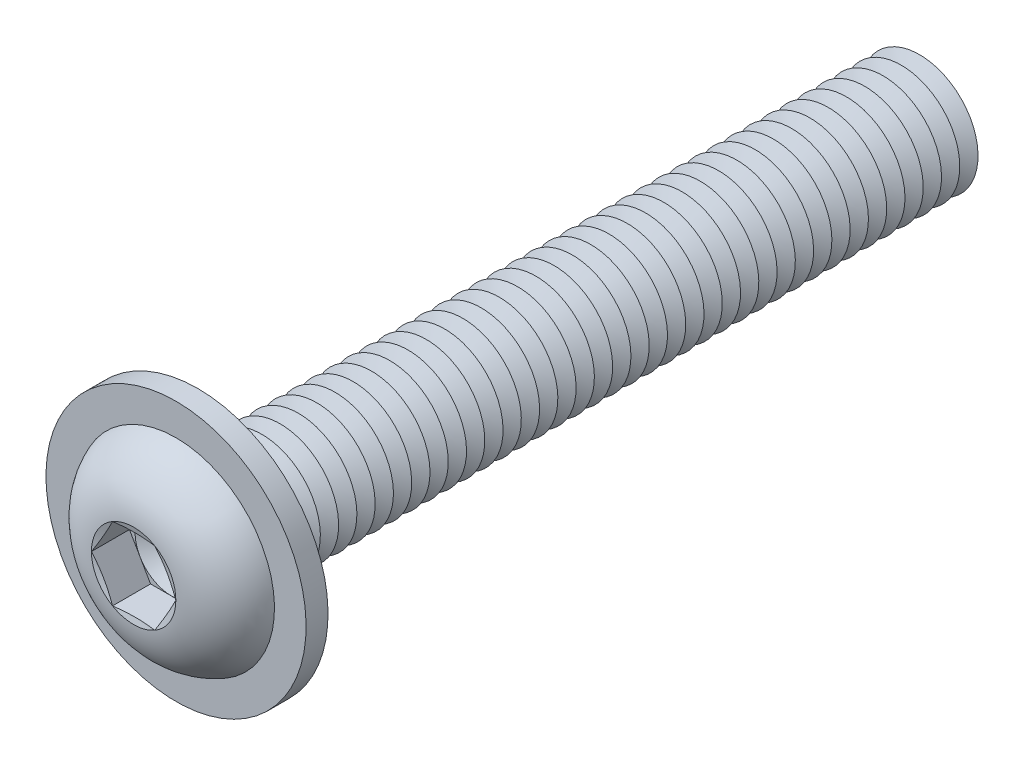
ISO-10303-21;
HEADER;
FILE_DESCRIPTION(('STEP AP214'),'2;1');
FILE_NAME('part.step','',(''),(''),'','','');
FILE_SCHEMA(('AUTOMOTIVE_DESIGN { 1 0 10303 214 1 1 1 1 }'));
ENDSEC;
DATA;
#1=APPLICATION_CONTEXT('core data for automotive mechanical design processes');
#2=APPLICATION_PROTOCOL_DEFINITION('international standard','automotive_design',2000,#1);
#3=PRODUCT_CONTEXT('',#1,'mechanical');
#4=PRODUCT('Part','Part','',(#3));
#5=PRODUCT_RELATED_PRODUCT_CATEGORY('part','',(#4));
#6=PRODUCT_DEFINITION_FORMATION('','',#4);
#7=PRODUCT_DEFINITION_CONTEXT('part definition',#1,'design');
#8=PRODUCT_DEFINITION('design','',#6,#7);
#9=PRODUCT_DEFINITION_SHAPE('','',#8);
#10=(LENGTH_UNIT() NAMED_UNIT(*) SI_UNIT(.MILLI.,.METRE.));
#11=(NAMED_UNIT(*) PLANE_ANGLE_UNIT() SI_UNIT($,.RADIAN.));
#12=(NAMED_UNIT(*) SI_UNIT($,.STERADIAN.) SOLID_ANGLE_UNIT());
#13=UNCERTAINTY_MEASURE_WITH_UNIT(LENGTH_MEASURE(1.E-05),#10,'distance_accuracy_value','');
#14=(GEOMETRIC_REPRESENTATION_CONTEXT(3) GLOBAL_UNCERTAINTY_ASSIGNED_CONTEXT((#13)) GLOBAL_UNIT_ASSIGNED_CONTEXT((#10,
#11,#12)) REPRESENTATION_CONTEXT('',''));
#15=CARTESIAN_POINT('',(0.,0.,0.));
#16=DIRECTION('',(0.,0.,1.));
#17=DIRECTION('',(1.,0.,0.));
#18=AXIS2_PLACEMENT_3D('',#15,#16,#17);
#19=CARTESIAN_POINT('',(0.,0.,-45.625));
#20=DIRECTION('',(0.,0.,1.));
#21=DIRECTION('',(0.,-1.,0.));
#22=AXIS2_PLACEMENT_3D('',#19,#20,#21);
#23=CONICAL_SURFACE('',#22,3.99999999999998,1.0471975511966);
#24=CARTESIAN_POINT('',(0.,0.,-46.25));
#25=DIRECTION('',(0.,0.,1.));
#26=DIRECTION('',(0.,-1.,0.));
#27=AXIS2_PLACEMENT_3D('',#24,#25,#26);
#28=CIRCLE('',#27,2.91746824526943);
#29=CARTESIAN_POINT('',(0.,-2.91746824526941,-46.25));
#30=VERTEX_POINT('',#29);
#31=EDGE_CURVE('E528',#30,#30,#28,.T.);
#32=ORIENTED_EDGE('',*,*,#31,.T.);
#33=EDGE_LOOP('',(#32));
#34=FACE_BOUND('',#33,.T.);
#35=CARTESIAN_POINT('',(0.,0.,-45.625));
#36=DIRECTION('',(0.,0.,1.));
#37=DIRECTION('',(0.,-1.,0.));
#38=AXIS2_PLACEMENT_3D('',#35,#36,#37);
#39=CIRCLE('',#38,3.99999999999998);
#40=CARTESIAN_POINT('',(0.,-3.99999999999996,-45.625));
#41=VERTEX_POINT('',#40);
#42=EDGE_CURVE('E524',#41,#41,#39,.T.);
#43=ORIENTED_EDGE('',*,*,#42,.F.);
#44=EDGE_LOOP('',(#43));
#45=FACE_BOUND('',#44,.T.);
#46=ADVANCED_FACE('F39',(#34,#45),#23,.T.);
#47=CARTESIAN_POINT('',(0.,0.,-46.25));
#48=DIRECTION('',(0.,0.,-1.));
#49=DIRECTION('',(0.,1.,0.));
#50=AXIS2_PLACEMENT_3D('',#47,#48,#49);
#51=CONICAL_SURFACE('',#50,2.91746824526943,1.0471975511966);
#52=CARTESIAN_POINT('',(0.,0.,-46.875));
#53=DIRECTION('',(0.,0.,1.));
#54=DIRECTION('',(0.,-1.,0.));
#55=AXIS2_PLACEMENT_3D('',#52,#53,#54);
#56=CIRCLE('',#55,3.99999999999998);
#57=CARTESIAN_POINT('',(0.,-3.99999999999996,-46.875));
#58=VERTEX_POINT('',#57);
#59=EDGE_CURVE('E532',#58,#58,#56,.T.);
#60=ORIENTED_EDGE('',*,*,#59,.T.);
#61=EDGE_LOOP('',(#60));
#62=FACE_BOUND('',#61,.T.);
#63=ORIENTED_EDGE('',*,*,#31,.F.);
#64=EDGE_LOOP('',(#63));
#65=FACE_BOUND('',#64,.T.);
#66=ADVANCED_FACE('F649',(#62,#65),#51,.T.);
#67=CARTESIAN_POINT('',(0.,3.99999999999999,-50.));
#68=DIRECTION('',(0.,0.,-1.));
#69=DIRECTION('',(0.,1.,0.));
#70=AXIS2_PLACEMENT_3D('',#67,#68,#69);
#71=PLANE('',#70);
#72=CARTESIAN_POINT('',(0.,0.,-50.));
#73=DIRECTION('',(0.,0.,1.));
#74=DIRECTION('',(0.,-1.,0.));
#75=AXIS2_PLACEMENT_3D('',#72,#73,#74);
#76=CIRCLE('',#75,2.91746824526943);
#77=CARTESIAN_POINT('',(0.,-2.91746824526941,-50.));
#78=VERTEX_POINT('',#77);
#79=EDGE_CURVE('E552',#78,#78,#76,.T.);
#80=ORIENTED_EDGE('',*,*,#79,.F.);
#81=EDGE_LOOP('',(#80));
#82=FACE_BOUND('',#81,.T.);
#83=ADVANCED_FACE('F655',(#82),#71,.T.);
#84=CARTESIAN_POINT('',(0.,0.,-49.375));
#85=DIRECTION('',(0.,0.,1.));
#86=DIRECTION('',(0.,-1.,0.));
#87=AXIS2_PLACEMENT_3D('',#84,#85,#86);
#88=CONICAL_SURFACE('',#87,3.99999999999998,1.0471975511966);
#89=ORIENTED_EDGE('',*,*,#79,.T.);
#90=EDGE_LOOP('',(#89));
#91=FACE_BOUND('',#90,.T.);
#92=CARTESIAN_POINT('',(0.,0.,-49.375));
#93=DIRECTION('',(0.,0.,1.));
#94=DIRECTION('',(0.,-1.,0.));
#95=AXIS2_PLACEMENT_3D('',#92,#93,#94);
#96=CIRCLE('',#95,3.99999999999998);
#97=CARTESIAN_POINT('',(0.,-3.99999999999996,-49.375));
#98=VERTEX_POINT('',#97);
#99=EDGE_CURVE('E548',#98,#98,#96,.T.);
#100=ORIENTED_EDGE('',*,*,#99,.F.);
#101=EDGE_LOOP('',(#100));
#102=FACE_BOUND('',#101,.T.);
#103=ADVANCED_FACE('F674',(#91,#102),#88,.T.);
#104=CARTESIAN_POINT('',(0.,0.,-48.75));
#105=DIRECTION('',(0.,0.,-1.));
#106=DIRECTION('',(0.,1.,0.));
#107=AXIS2_PLACEMENT_3D('',#104,#105,#106);
#108=CONICAL_SURFACE('',#107,2.91746824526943,1.0471975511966);
#109=ORIENTED_EDGE('',*,*,#99,.T.);
#110=EDGE_LOOP('',(#109));
#111=FACE_BOUND('',#110,.T.);
#112=CARTESIAN_POINT('',(0.,0.,-48.75));
#113=DIRECTION('',(0.,0.,1.));
#114=DIRECTION('',(0.,-1.,0.));
#115=AXIS2_PLACEMENT_3D('',#112,#113,#114);
#116=CIRCLE('',#115,2.91746824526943);
#117=CARTESIAN_POINT('',(0.,-2.91746824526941,-48.75));
#118=VERTEX_POINT('',#117);
#119=EDGE_CURVE('E544',#118,#118,#116,.T.);
#120=ORIENTED_EDGE('',*,*,#119,.F.);
#121=EDGE_LOOP('',(#120));
#122=FACE_BOUND('',#121,.T.);
#123=ADVANCED_FACE('F671',(#111,#122),#108,.T.);
#124=CARTESIAN_POINT('',(0.,0.,-48.125));
#125=DIRECTION('',(0.,0.,1.));
#126=DIRECTION('',(0.,-1.,0.));
#127=AXIS2_PLACEMENT_3D('',#124,#125,#126);
#128=CONICAL_SURFACE('',#127,3.99999999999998,1.0471975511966);
#129=ORIENTED_EDGE('',*,*,#119,.T.);
#130=EDGE_LOOP('',(#129));
#131=FACE_BOUND('',#130,.T.);
#132=CARTESIAN_POINT('',(0.,0.,-48.125));
#133=DIRECTION('',(0.,0.,1.));
#134=DIRECTION('',(0.,-1.,0.));
#135=AXIS2_PLACEMENT_3D('',#132,#133,#134);
#136=CIRCLE('',#135,3.99999999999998);
#137=CARTESIAN_POINT('',(0.,-3.99999999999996,-48.125));
#138=VERTEX_POINT('',#137);
#139=EDGE_CURVE('E540',#138,#138,#136,.T.);
#140=ORIENTED_EDGE('',*,*,#139,.F.);
#141=EDGE_LOOP('',(#140));
#142=FACE_BOUND('',#141,.T.);
#143=ADVANCED_FACE('F665',(#131,#142),#128,.T.);
#144=CARTESIAN_POINT('',(0.,0.,-47.5));
#145=DIRECTION('',(0.,0.,-1.));
#146=DIRECTION('',(0.,1.,0.));
#147=AXIS2_PLACEMENT_3D('',#144,#145,#146);
#148=CONICAL_SURFACE('',#147,2.91746824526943,1.0471975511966);
#149=ORIENTED_EDGE('',*,*,#139,.T.);
#150=EDGE_LOOP('',(#149));
#151=FACE_BOUND('',#150,.T.);
#152=CARTESIAN_POINT('',(0.,0.,-47.5));
#153=DIRECTION('',(0.,0.,1.));
#154=DIRECTION('',(0.,-1.,0.));
#155=AXIS2_PLACEMENT_3D('',#152,#153,#154);
#156=CIRCLE('',#155,2.91746824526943);
#157=CARTESIAN_POINT('',(0.,-2.91746824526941,-47.5));
#158=VERTEX_POINT('',#157);
#159=EDGE_CURVE('E536',#158,#158,#156,.T.);
#160=ORIENTED_EDGE('',*,*,#159,.F.);
#161=EDGE_LOOP('',(#160));
#162=FACE_BOUND('',#161,.T.);
#163=ADVANCED_FACE('F661',(#151,#162),#148,.T.);
#164=CARTESIAN_POINT('',(0.,0.,-46.875));
#165=DIRECTION('',(0.,0.,1.));
#166=DIRECTION('',(0.,-1.,0.));
#167=AXIS2_PLACEMENT_3D('',#164,#165,#166);
#168=CONICAL_SURFACE('',#167,3.99999999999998,1.0471975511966);
#169=ORIENTED_EDGE('',*,*,#159,.T.);
#170=EDGE_LOOP('',(#169));
#171=FACE_BOUND('',#170,.T.);
#172=ORIENTED_EDGE('',*,*,#59,.F.);
#173=EDGE_LOOP('',(#172));
#174=FACE_BOUND('',#173,.T.);
#175=ADVANCED_FACE('F664',(#171,#174),#168,.T.);
#176=CARTESIAN_POINT('',(0.,0.,-44.375));
#177=DIRECTION('',(0.,0.,1.));
#178=DIRECTION('',(0.,-1.,0.));
#179=AXIS2_PLACEMENT_3D('',#176,#177,#178);
#180=CONICAL_SURFACE('',#179,3.99999999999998,1.0471975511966);
#181=CARTESIAN_POINT('',(0.,0.,-45.));
#182=DIRECTION('',(0.,0.,1.));
#183=DIRECTION('',(0.,-1.,0.));
#184=AXIS2_PLACEMENT_3D('',#181,#182,#183);
#185=CIRCLE('',#184,2.91746824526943);
#186=CARTESIAN_POINT('',(0.,-2.91746824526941,-45.));
#187=VERTEX_POINT('',#186);
#188=EDGE_CURVE('E520',#187,#187,#185,.T.);
#189=ORIENTED_EDGE('',*,*,#188,.T.);
#190=EDGE_LOOP('',(#189));
#191=FACE_BOUND('',#190,.T.);
#192=CARTESIAN_POINT('',(0.,0.,-44.375));
#193=DIRECTION('',(0.,0.,1.));
#194=DIRECTION('',(0.,-1.,0.));
#195=AXIS2_PLACEMENT_3D('',#192,#193,#194);
#196=CIRCLE('',#195,3.99999999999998);
#197=CARTESIAN_POINT('',(0.,-3.99999999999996,-44.375));
#198=VERTEX_POINT('',#197);
#199=EDGE_CURVE('E516',#198,#198,#196,.T.);
#200=ORIENTED_EDGE('',*,*,#199,.F.);
#201=EDGE_LOOP('',(#200));
#202=FACE_BOUND('',#201,.T.);
#203=ADVANCED_FACE('F669',(#191,#202),#180,.T.);
#204=CARTESIAN_POINT('',(0.,0.,-45.));
#205=DIRECTION('',(0.,0.,-1.));
#206=DIRECTION('',(0.,1.,0.));
#207=AXIS2_PLACEMENT_3D('',#204,#205,#206);
#208=CONICAL_SURFACE('',#207,2.91746824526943,1.0471975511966);
#209=ORIENTED_EDGE('',*,*,#42,.T.);
#210=EDGE_LOOP('',(#209));
#211=FACE_BOUND('',#210,.T.);
#212=ORIENTED_EDGE('',*,*,#188,.F.);
#213=EDGE_LOOP('',(#212));
#214=FACE_BOUND('',#213,.T.);
#215=ADVANCED_FACE('F720',(#211,#214),#208,.T.);
#216=CARTESIAN_POINT('',(0.,0.,-43.125));
#217=DIRECTION('',(0.,0.,1.));
#218=DIRECTION('',(0.,-1.,0.));
#219=AXIS2_PLACEMENT_3D('',#216,#217,#218);
#220=CONICAL_SURFACE('',#219,3.99999999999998,1.0471975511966);
#221=CARTESIAN_POINT('',(0.,0.,-43.75));
#222=DIRECTION('',(0.,0.,1.));
#223=DIRECTION('',(0.,-1.,0.));
#224=AXIS2_PLACEMENT_3D('',#221,#222,#223);
#225=CIRCLE('',#224,2.91746824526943);
#226=CARTESIAN_POINT('',(0.,-2.91746824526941,-43.75));
#227=VERTEX_POINT('',#226);
#228=EDGE_CURVE('E512',#227,#227,#225,.T.);
#229=ORIENTED_EDGE('',*,*,#228,.T.);
#230=EDGE_LOOP('',(#229));
#231=FACE_BOUND('',#230,.T.);
#232=CARTESIAN_POINT('',(0.,0.,-43.125));
#233=DIRECTION('',(0.,0.,1.));
#234=DIRECTION('',(0.,-1.,0.));
#235=AXIS2_PLACEMENT_3D('',#232,#233,#234);
#236=CIRCLE('',#235,3.99999999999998);
#237=CARTESIAN_POINT('',(0.,-3.99999999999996,-43.125));
#238=VERTEX_POINT('',#237);
#239=EDGE_CURVE('E508',#238,#238,#236,.T.);
#240=ORIENTED_EDGE('',*,*,#239,.F.);
#241=EDGE_LOOP('',(#240));
#242=FACE_BOUND('',#241,.T.);
#243=ADVANCED_FACE('F726',(#231,#242),#220,.T.);
#244=CARTESIAN_POINT('',(0.,0.,-43.75));
#245=DIRECTION('',(0.,0.,-1.));
#246=DIRECTION('',(0.,1.,0.));
#247=AXIS2_PLACEMENT_3D('',#244,#245,#246);
#248=CONICAL_SURFACE('',#247,2.91746824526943,1.0471975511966);
#249=ORIENTED_EDGE('',*,*,#199,.T.);
#250=EDGE_LOOP('',(#249));
#251=FACE_BOUND('',#250,.T.);
#252=ORIENTED_EDGE('',*,*,#228,.F.);
#253=EDGE_LOOP('',(#252));
#254=FACE_BOUND('',#253,.T.);
#255=ADVANCED_FACE('F733',(#251,#254),#248,.T.);
#256=CARTESIAN_POINT('',(0.,0.,-41.875));
#257=DIRECTION('',(0.,0.,1.));
#258=DIRECTION('',(0.,-1.,0.));
#259=AXIS2_PLACEMENT_3D('',#256,#257,#258);
#260=CONICAL_SURFACE('',#259,3.99999999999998,1.0471975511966);
#261=CARTESIAN_POINT('',(0.,0.,-42.5));
#262=DIRECTION('',(0.,0.,1.));
#263=DIRECTION('',(0.,-1.,0.));
#264=AXIS2_PLACEMENT_3D('',#261,#262,#263);
#265=CIRCLE('',#264,2.91746824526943);
#266=CARTESIAN_POINT('',(0.,-2.91746824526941,-42.5));
#267=VERTEX_POINT('',#266);
#268=EDGE_CURVE('E504',#267,#267,#265,.T.);
#269=ORIENTED_EDGE('',*,*,#268,.T.);
#270=EDGE_LOOP('',(#269));
#271=FACE_BOUND('',#270,.T.);
#272=CARTESIAN_POINT('',(0.,0.,-41.875));
#273=DIRECTION('',(0.,0.,1.));
#274=DIRECTION('',(0.,-1.,0.));
#275=AXIS2_PLACEMENT_3D('',#272,#273,#274);
#276=CIRCLE('',#275,3.99999999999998);
#277=CARTESIAN_POINT('',(0.,-3.99999999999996,-41.875));
#278=VERTEX_POINT('',#277);
#279=EDGE_CURVE('E500',#278,#278,#276,.T.);
#280=ORIENTED_EDGE('',*,*,#279,.F.);
#281=EDGE_LOOP('',(#280));
#282=FACE_BOUND('',#281,.T.);
#283=ADVANCED_FACE('F740',(#271,#282),#260,.T.);
#284=CARTESIAN_POINT('',(0.,0.,-42.5));
#285=DIRECTION('',(0.,0.,-1.));
#286=DIRECTION('',(0.,1.,0.));
#287=AXIS2_PLACEMENT_3D('',#284,#285,#286);
#288=CONICAL_SURFACE('',#287,2.91746824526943,1.0471975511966);
#289=ORIENTED_EDGE('',*,*,#239,.T.);
#290=EDGE_LOOP('',(#289));
#291=FACE_BOUND('',#290,.T.);
#292=ORIENTED_EDGE('',*,*,#268,.F.);
#293=EDGE_LOOP('',(#292));
#294=FACE_BOUND('',#293,.T.);
#295=ADVANCED_FACE('F747',(#291,#294),#288,.T.);
#296=CARTESIAN_POINT('',(0.,0.,-40.625));
#297=DIRECTION('',(0.,0.,1.));
#298=DIRECTION('',(0.,-1.,0.));
#299=AXIS2_PLACEMENT_3D('',#296,#297,#298);
#300=CONICAL_SURFACE('',#299,3.99999999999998,1.0471975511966);
#301=CARTESIAN_POINT('',(0.,0.,-41.25));
#302=DIRECTION('',(0.,0.,1.));
#303=DIRECTION('',(0.,-1.,0.));
#304=AXIS2_PLACEMENT_3D('',#301,#302,#303);
#305=CIRCLE('',#304,2.91746824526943);
#306=CARTESIAN_POINT('',(0.,-2.91746824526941,-41.25));
#307=VERTEX_POINT('',#306);
#308=EDGE_CURVE('E496',#307,#307,#305,.T.);
#309=ORIENTED_EDGE('',*,*,#308,.T.);
#310=EDGE_LOOP('',(#309));
#311=FACE_BOUND('',#310,.T.);
#312=CARTESIAN_POINT('',(0.,0.,-40.625));
#313=DIRECTION('',(0.,0.,1.));
#314=DIRECTION('',(0.,-1.,0.));
#315=AXIS2_PLACEMENT_3D('',#312,#313,#314);
#316=CIRCLE('',#315,3.99999999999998);
#317=CARTESIAN_POINT('',(0.,-3.99999999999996,-40.625));
#318=VERTEX_POINT('',#317);
#319=EDGE_CURVE('E492',#318,#318,#316,.T.);
#320=ORIENTED_EDGE('',*,*,#319,.F.);
#321=EDGE_LOOP('',(#320));
#322=FACE_BOUND('',#321,.T.);
#323=ADVANCED_FACE('F754',(#311,#322),#300,.T.);
#324=CARTESIAN_POINT('',(0.,0.,-41.25));
#325=DIRECTION('',(0.,0.,-1.));
#326=DIRECTION('',(0.,1.,0.));
#327=AXIS2_PLACEMENT_3D('',#324,#325,#326);
#328=CONICAL_SURFACE('',#327,2.91746824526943,1.0471975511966);
#329=ORIENTED_EDGE('',*,*,#279,.T.);
#330=EDGE_LOOP('',(#329));
#331=FACE_BOUND('',#330,.T.);
#332=ORIENTED_EDGE('',*,*,#308,.F.);
#333=EDGE_LOOP('',(#332));
#334=FACE_BOUND('',#333,.T.);
#335=ADVANCED_FACE('F761',(#331,#334),#328,.T.);
#336=CARTESIAN_POINT('',(0.,0.,-39.375));
#337=DIRECTION('',(0.,0.,1.));
#338=DIRECTION('',(0.,-1.,0.));
#339=AXIS2_PLACEMENT_3D('',#336,#337,#338);
#340=CONICAL_SURFACE('',#339,3.99999999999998,1.0471975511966);
#341=CARTESIAN_POINT('',(0.,0.,-40.));
#342=DIRECTION('',(0.,0.,1.));
#343=DIRECTION('',(0.,-1.,0.));
#344=AXIS2_PLACEMENT_3D('',#341,#342,#343);
#345=CIRCLE('',#344,2.91746824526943);
#346=CARTESIAN_POINT('',(0.,-2.91746824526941,-40.));
#347=VERTEX_POINT('',#346);
#348=EDGE_CURVE('E488',#347,#347,#345,.T.);
#349=ORIENTED_EDGE('',*,*,#348,.T.);
#350=EDGE_LOOP('',(#349));
#351=FACE_BOUND('',#350,.T.);
#352=CARTESIAN_POINT('',(0.,0.,-39.375));
#353=DIRECTION('',(0.,0.,1.));
#354=DIRECTION('',(0.,-1.,0.));
#355=AXIS2_PLACEMENT_3D('',#352,#353,#354);
#356=CIRCLE('',#355,3.99999999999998);
#357=CARTESIAN_POINT('',(0.,-3.99999999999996,-39.375));
#358=VERTEX_POINT('',#357);
#359=EDGE_CURVE('E484',#358,#358,#356,.T.);
#360=ORIENTED_EDGE('',*,*,#359,.F.);
#361=EDGE_LOOP('',(#360));
#362=FACE_BOUND('',#361,.T.);
#363=ADVANCED_FACE('F768',(#351,#362),#340,.T.);
#364=CARTESIAN_POINT('',(0.,0.,-40.));
#365=DIRECTION('',(0.,0.,-1.));
#366=DIRECTION('',(0.,1.,0.));
#367=AXIS2_PLACEMENT_3D('',#364,#365,#366);
#368=CONICAL_SURFACE('',#367,2.91746824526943,1.0471975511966);
#369=ORIENTED_EDGE('',*,*,#319,.T.);
#370=EDGE_LOOP('',(#369));
#371=FACE_BOUND('',#370,.T.);
#372=ORIENTED_EDGE('',*,*,#348,.F.);
#373=EDGE_LOOP('',(#372));
#374=FACE_BOUND('',#373,.T.);
#375=ADVANCED_FACE('F775',(#371,#374),#368,.T.);
#376=CARTESIAN_POINT('',(0.,0.,-38.125));
#377=DIRECTION('',(0.,0.,1.));
#378=DIRECTION('',(0.,-1.,0.));
#379=AXIS2_PLACEMENT_3D('',#376,#377,#378);
#380=CONICAL_SURFACE('',#379,3.99999999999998,1.0471975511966);
#381=CARTESIAN_POINT('',(0.,0.,-38.75));
#382=DIRECTION('',(0.,0.,1.));
#383=DIRECTION('',(0.,-1.,0.));
#384=AXIS2_PLACEMENT_3D('',#381,#382,#383);
#385=CIRCLE('',#384,2.91746824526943);
#386=CARTESIAN_POINT('',(0.,-2.91746824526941,-38.75));
#387=VERTEX_POINT('',#386);
#388=EDGE_CURVE('E480',#387,#387,#385,.T.);
#389=ORIENTED_EDGE('',*,*,#388,.T.);
#390=EDGE_LOOP('',(#389));
#391=FACE_BOUND('',#390,.T.);
#392=CARTESIAN_POINT('',(0.,0.,-38.125));
#393=DIRECTION('',(0.,0.,1.));
#394=DIRECTION('',(0.,-1.,0.));
#395=AXIS2_PLACEMENT_3D('',#392,#393,#394);
#396=CIRCLE('',#395,3.99999999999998);
#397=CARTESIAN_POINT('',(0.,-3.99999999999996,-38.125));
#398=VERTEX_POINT('',#397);
#399=EDGE_CURVE('E476',#398,#398,#396,.T.);
#400=ORIENTED_EDGE('',*,*,#399,.F.);
#401=EDGE_LOOP('',(#400));
#402=FACE_BOUND('',#401,.T.);
#403=ADVANCED_FACE('F782',(#391,#402),#380,.T.);
#404=CARTESIAN_POINT('',(0.,0.,-38.75));
#405=DIRECTION('',(0.,0.,-1.));
#406=DIRECTION('',(0.,1.,0.));
#407=AXIS2_PLACEMENT_3D('',#404,#405,#406);
#408=CONICAL_SURFACE('',#407,2.91746824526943,1.0471975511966);
#409=ORIENTED_EDGE('',*,*,#359,.T.);
#410=EDGE_LOOP('',(#409));
#411=FACE_BOUND('',#410,.T.);
#412=ORIENTED_EDGE('',*,*,#388,.F.);
#413=EDGE_LOOP('',(#412));
#414=FACE_BOUND('',#413,.T.);
#415=ADVANCED_FACE('F789',(#411,#414),#408,.T.);
#416=CARTESIAN_POINT('',(0.,0.,-36.875));
#417=DIRECTION('',(0.,0.,1.));
#418=DIRECTION('',(0.,-1.,0.));
#419=AXIS2_PLACEMENT_3D('',#416,#417,#418);
#420=CONICAL_SURFACE('',#419,3.99999999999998,1.0471975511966);
#421=CARTESIAN_POINT('',(0.,0.,-37.5));
#422=DIRECTION('',(0.,0.,1.));
#423=DIRECTION('',(0.,-1.,0.));
#424=AXIS2_PLACEMENT_3D('',#421,#422,#423);
#425=CIRCLE('',#424,2.91746824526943);
#426=CARTESIAN_POINT('',(0.,-2.91746824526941,-37.5));
#427=VERTEX_POINT('',#426);
#428=EDGE_CURVE('E472',#427,#427,#425,.T.);
#429=ORIENTED_EDGE('',*,*,#428,.T.);
#430=EDGE_LOOP('',(#429));
#431=FACE_BOUND('',#430,.T.);
#432=CARTESIAN_POINT('',(0.,0.,-36.875));
#433=DIRECTION('',(0.,0.,1.));
#434=DIRECTION('',(0.,-1.,0.));
#435=AXIS2_PLACEMENT_3D('',#432,#433,#434);
#436=CIRCLE('',#435,3.99999999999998);
#437=CARTESIAN_POINT('',(0.,-3.99999999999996,-36.875));
#438=VERTEX_POINT('',#437);
#439=EDGE_CURVE('E468',#438,#438,#436,.T.);
#440=ORIENTED_EDGE('',*,*,#439,.F.);
#441=EDGE_LOOP('',(#440));
#442=FACE_BOUND('',#441,.T.);
#443=ADVANCED_FACE('F796',(#431,#442),#420,.T.);
#444=CARTESIAN_POINT('',(0.,0.,-37.5));
#445=DIRECTION('',(0.,0.,-1.));
#446=DIRECTION('',(0.,1.,0.));
#447=AXIS2_PLACEMENT_3D('',#444,#445,#446);
#448=CONICAL_SURFACE('',#447,2.91746824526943,1.0471975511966);
#449=ORIENTED_EDGE('',*,*,#399,.T.);
#450=EDGE_LOOP('',(#449));
#451=FACE_BOUND('',#450,.T.);
#452=ORIENTED_EDGE('',*,*,#428,.F.);
#453=EDGE_LOOP('',(#452));
#454=FACE_BOUND('',#453,.T.);
#455=ADVANCED_FACE('F803',(#451,#454),#448,.T.);
#456=CARTESIAN_POINT('',(0.,0.,-35.625));
#457=DIRECTION('',(0.,0.,1.));
#458=DIRECTION('',(0.,-1.,0.));
#459=AXIS2_PLACEMENT_3D('',#456,#457,#458);
#460=CONICAL_SURFACE('',#459,3.99999999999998,1.0471975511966);
#461=CARTESIAN_POINT('',(0.,0.,-36.25));
#462=DIRECTION('',(0.,0.,1.));
#463=DIRECTION('',(0.,-1.,0.));
#464=AXIS2_PLACEMENT_3D('',#461,#462,#463);
#465=CIRCLE('',#464,2.91746824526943);
#466=CARTESIAN_POINT('',(0.,-2.91746824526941,-36.25));
#467=VERTEX_POINT('',#466);
#468=EDGE_CURVE('E464',#467,#467,#465,.T.);
#469=ORIENTED_EDGE('',*,*,#468,.T.);
#470=EDGE_LOOP('',(#469));
#471=FACE_BOUND('',#470,.T.);
#472=CARTESIAN_POINT('',(0.,0.,-35.625));
#473=DIRECTION('',(0.,0.,1.));
#474=DIRECTION('',(0.,-1.,0.));
#475=AXIS2_PLACEMENT_3D('',#472,#473,#474);
#476=CIRCLE('',#475,3.99999999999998);
#477=CARTESIAN_POINT('',(0.,-3.99999999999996,-35.625));
#478=VERTEX_POINT('',#477);
#479=EDGE_CURVE('E460',#478,#478,#476,.T.);
#480=ORIENTED_EDGE('',*,*,#479,.F.);
#481=EDGE_LOOP('',(#480));
#482=FACE_BOUND('',#481,.T.);
#483=ADVANCED_FACE('F810',(#471,#482),#460,.T.);
#484=CARTESIAN_POINT('',(0.,0.,-36.25));
#485=DIRECTION('',(0.,0.,-1.));
#486=DIRECTION('',(0.,1.,0.));
#487=AXIS2_PLACEMENT_3D('',#484,#485,#486);
#488=CONICAL_SURFACE('',#487,2.91746824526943,1.0471975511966);
#489=ORIENTED_EDGE('',*,*,#439,.T.);
#490=EDGE_LOOP('',(#489));
#491=FACE_BOUND('',#490,.T.);
#492=ORIENTED_EDGE('',*,*,#468,.F.);
#493=EDGE_LOOP('',(#492));
#494=FACE_BOUND('',#493,.T.);
#495=ADVANCED_FACE('F817',(#491,#494),#488,.T.);
#496=CARTESIAN_POINT('',(0.,0.,-34.375));
#497=DIRECTION('',(0.,0.,1.));
#498=DIRECTION('',(0.,-1.,0.));
#499=AXIS2_PLACEMENT_3D('',#496,#497,#498);
#500=CONICAL_SURFACE('',#499,3.99999999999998,1.0471975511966);
#501=CARTESIAN_POINT('',(0.,0.,-35.));
#502=DIRECTION('',(0.,0.,1.));
#503=DIRECTION('',(0.,-1.,0.));
#504=AXIS2_PLACEMENT_3D('',#501,#502,#503);
#505=CIRCLE('',#504,2.91746824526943);
#506=CARTESIAN_POINT('',(0.,-2.91746824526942,-35.));
#507=VERTEX_POINT('',#506);
#508=EDGE_CURVE('E456',#507,#507,#505,.T.);
#509=ORIENTED_EDGE('',*,*,#508,.T.);
#510=EDGE_LOOP('',(#509));
#511=FACE_BOUND('',#510,.T.);
#512=CARTESIAN_POINT('',(0.,0.,-34.375));
#513=DIRECTION('',(0.,0.,1.));
#514=DIRECTION('',(0.,-1.,0.));
#515=AXIS2_PLACEMENT_3D('',#512,#513,#514);
#516=CIRCLE('',#515,3.99999999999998);
#517=CARTESIAN_POINT('',(0.,-3.99999999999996,-34.375));
#518=VERTEX_POINT('',#517);
#519=EDGE_CURVE('E452',#518,#518,#516,.T.);
#520=ORIENTED_EDGE('',*,*,#519,.F.);
#521=EDGE_LOOP('',(#520));
#522=FACE_BOUND('',#521,.T.);
#523=ADVANCED_FACE('F824',(#511,#522),#500,.T.);
#524=CARTESIAN_POINT('',(0.,0.,-35.));
#525=DIRECTION('',(0.,0.,-1.));
#526=DIRECTION('',(0.,1.,0.));
#527=AXIS2_PLACEMENT_3D('',#524,#525,#526);
#528=CONICAL_SURFACE('',#527,2.91746824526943,1.0471975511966);
#529=ORIENTED_EDGE('',*,*,#479,.T.);
#530=EDGE_LOOP('',(#529));
#531=FACE_BOUND('',#530,.T.);
#532=ORIENTED_EDGE('',*,*,#508,.F.);
#533=EDGE_LOOP('',(#532));
#534=FACE_BOUND('',#533,.T.);
#535=ADVANCED_FACE('F831',(#531,#534),#528,.T.);
#536=CARTESIAN_POINT('',(0.,0.,-33.125));
#537=DIRECTION('',(0.,0.,1.));
#538=DIRECTION('',(0.,-1.,0.));
#539=AXIS2_PLACEMENT_3D('',#536,#537,#538);
#540=CONICAL_SURFACE('',#539,3.99999999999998,1.0471975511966);
#541=CARTESIAN_POINT('',(0.,0.,-33.75));
#542=DIRECTION('',(0.,0.,1.));
#543=DIRECTION('',(0.,-1.,0.));
#544=AXIS2_PLACEMENT_3D('',#541,#542,#543);
#545=CIRCLE('',#544,2.91746824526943);
#546=CARTESIAN_POINT('',(0.,-2.91746824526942,-33.75));
#547=VERTEX_POINT('',#546);
#548=EDGE_CURVE('E448',#547,#547,#545,.T.);
#549=ORIENTED_EDGE('',*,*,#548,.T.);
#550=EDGE_LOOP('',(#549));
#551=FACE_BOUND('',#550,.T.);
#552=CARTESIAN_POINT('',(0.,0.,-33.125));
#553=DIRECTION('',(0.,0.,1.));
#554=DIRECTION('',(0.,-1.,0.));
#555=AXIS2_PLACEMENT_3D('',#552,#553,#554);
#556=CIRCLE('',#555,3.99999999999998);
#557=CARTESIAN_POINT('',(0.,-3.99999999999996,-33.125));
#558=VERTEX_POINT('',#557);
#559=EDGE_CURVE('E444',#558,#558,#556,.T.);
#560=ORIENTED_EDGE('',*,*,#559,.F.);
#561=EDGE_LOOP('',(#560));
#562=FACE_BOUND('',#561,.T.);
#563=ADVANCED_FACE('F838',(#551,#562),#540,.T.);
#564=CARTESIAN_POINT('',(0.,0.,-33.75));
#565=DIRECTION('',(0.,0.,-1.));
#566=DIRECTION('',(0.,1.,0.));
#567=AXIS2_PLACEMENT_3D('',#564,#565,#566);
#568=CONICAL_SURFACE('',#567,2.91746824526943,1.0471975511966);
#569=ORIENTED_EDGE('',*,*,#519,.T.);
#570=EDGE_LOOP('',(#569));
#571=FACE_BOUND('',#570,.T.);
#572=ORIENTED_EDGE('',*,*,#548,.F.);
#573=EDGE_LOOP('',(#572));
#574=FACE_BOUND('',#573,.T.);
#575=ADVANCED_FACE('F845',(#571,#574),#568,.T.);
#576=CARTESIAN_POINT('',(0.,0.,-31.875));
#577=DIRECTION('',(0.,0.,1.));
#578=DIRECTION('',(0.,-1.,0.));
#579=AXIS2_PLACEMENT_3D('',#576,#577,#578);
#580=CONICAL_SURFACE('',#579,3.99999999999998,1.0471975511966);
#581=CARTESIAN_POINT('',(0.,0.,-32.5));
#582=DIRECTION('',(0.,0.,1.));
#583=DIRECTION('',(0.,-1.,0.));
#584=AXIS2_PLACEMENT_3D('',#581,#582,#583);
#585=CIRCLE('',#584,2.91746824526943);
#586=CARTESIAN_POINT('',(0.,-2.91746824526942,-32.5));
#587=VERTEX_POINT('',#586);
#588=EDGE_CURVE('E440',#587,#587,#585,.T.);
#589=ORIENTED_EDGE('',*,*,#588,.T.);
#590=EDGE_LOOP('',(#589));
#591=FACE_BOUND('',#590,.T.);
#592=CARTESIAN_POINT('',(0.,0.,-31.875));
#593=DIRECTION('',(0.,0.,1.));
#594=DIRECTION('',(0.,-1.,0.));
#595=AXIS2_PLACEMENT_3D('',#592,#593,#594);
#596=CIRCLE('',#595,3.99999999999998);
#597=CARTESIAN_POINT('',(0.,-3.99999999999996,-31.875));
#598=VERTEX_POINT('',#597);
#599=EDGE_CURVE('E436',#598,#598,#596,.T.);
#600=ORIENTED_EDGE('',*,*,#599,.F.);
#601=EDGE_LOOP('',(#600));
#602=FACE_BOUND('',#601,.T.);
#603=ADVANCED_FACE('F852',(#591,#602),#580,.T.);
#604=CARTESIAN_POINT('',(0.,0.,-32.5));
#605=DIRECTION('',(0.,0.,-1.));
#606=DIRECTION('',(0.,1.,0.));
#607=AXIS2_PLACEMENT_3D('',#604,#605,#606);
#608=CONICAL_SURFACE('',#607,2.91746824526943,1.0471975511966);
#609=ORIENTED_EDGE('',*,*,#559,.T.);
#610=EDGE_LOOP('',(#609));
#611=FACE_BOUND('',#610,.T.);
#612=ORIENTED_EDGE('',*,*,#588,.F.);
#613=EDGE_LOOP('',(#612));
#614=FACE_BOUND('',#613,.T.);
#615=ADVANCED_FACE('F859',(#611,#614),#608,.T.);
#616=CARTESIAN_POINT('',(0.,0.,-30.625));
#617=DIRECTION('',(0.,0.,1.));
#618=DIRECTION('',(0.,-1.,0.));
#619=AXIS2_PLACEMENT_3D('',#616,#617,#618);
#620=CONICAL_SURFACE('',#619,3.99999999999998,1.0471975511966);
#621=CARTESIAN_POINT('',(0.,0.,-31.25));
#622=DIRECTION('',(0.,0.,1.));
#623=DIRECTION('',(0.,-1.,0.));
#624=AXIS2_PLACEMENT_3D('',#621,#622,#623);
#625=CIRCLE('',#624,2.91746824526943);
#626=CARTESIAN_POINT('',(0.,-2.91746824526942,-31.25));
#627=VERTEX_POINT('',#626);
#628=EDGE_CURVE('E432',#627,#627,#625,.T.);
#629=ORIENTED_EDGE('',*,*,#628,.T.);
#630=EDGE_LOOP('',(#629));
#631=FACE_BOUND('',#630,.T.);
#632=CARTESIAN_POINT('',(0.,0.,-30.625));
#633=DIRECTION('',(0.,0.,1.));
#634=DIRECTION('',(0.,-1.,0.));
#635=AXIS2_PLACEMENT_3D('',#632,#633,#634);
#636=CIRCLE('',#635,3.99999999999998);
#637=CARTESIAN_POINT('',(0.,-3.99999999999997,-30.625));
#638=VERTEX_POINT('',#637);
#639=EDGE_CURVE('E428',#638,#638,#636,.T.);
#640=ORIENTED_EDGE('',*,*,#639,.F.);
#641=EDGE_LOOP('',(#640));
#642=FACE_BOUND('',#641,.T.);
#643=ADVANCED_FACE('F866',(#631,#642),#620,.T.);
#644=CARTESIAN_POINT('',(0.,0.,-31.25));
#645=DIRECTION('',(0.,0.,-1.));
#646=DIRECTION('',(0.,1.,0.));
#647=AXIS2_PLACEMENT_3D('',#644,#645,#646);
#648=CONICAL_SURFACE('',#647,2.91746824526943,1.0471975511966);
#649=ORIENTED_EDGE('',*,*,#599,.T.);
#650=EDGE_LOOP('',(#649));
#651=FACE_BOUND('',#650,.T.);
#652=ORIENTED_EDGE('',*,*,#628,.F.);
#653=EDGE_LOOP('',(#652));
#654=FACE_BOUND('',#653,.T.);
#655=ADVANCED_FACE('F873',(#651,#654),#648,.T.);
#656=CARTESIAN_POINT('',(0.,0.,-29.375));
#657=DIRECTION('',(0.,0.,1.));
#658=DIRECTION('',(0.,-1.,0.));
#659=AXIS2_PLACEMENT_3D('',#656,#657,#658);
#660=CONICAL_SURFACE('',#659,3.99999999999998,1.0471975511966);
#661=CARTESIAN_POINT('',(0.,0.,-30.));
#662=DIRECTION('',(0.,0.,1.));
#663=DIRECTION('',(0.,-1.,0.));
#664=AXIS2_PLACEMENT_3D('',#661,#662,#663);
#665=CIRCLE('',#664,2.91746824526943);
#666=CARTESIAN_POINT('',(0.,-2.91746824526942,-30.));
#667=VERTEX_POINT('',#666);
#668=EDGE_CURVE('E424',#667,#667,#665,.T.);
#669=ORIENTED_EDGE('',*,*,#668,.T.);
#670=EDGE_LOOP('',(#669));
#671=FACE_BOUND('',#670,.T.);
#672=CARTESIAN_POINT('',(0.,0.,-29.375));
#673=DIRECTION('',(0.,0.,1.));
#674=DIRECTION('',(0.,-1.,0.));
#675=AXIS2_PLACEMENT_3D('',#672,#673,#674);
#676=CIRCLE('',#675,3.99999999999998);
#677=CARTESIAN_POINT('',(0.,-3.99999999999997,-29.375));
#678=VERTEX_POINT('',#677);
#679=EDGE_CURVE('E420',#678,#678,#676,.T.);
#680=ORIENTED_EDGE('',*,*,#679,.F.);
#681=EDGE_LOOP('',(#680));
#682=FACE_BOUND('',#681,.T.);
#683=ADVANCED_FACE('F880',(#671,#682),#660,.T.);
#684=CARTESIAN_POINT('',(0.,0.,-30.));
#685=DIRECTION('',(0.,0.,-1.));
#686=DIRECTION('',(0.,1.,0.));
#687=AXIS2_PLACEMENT_3D('',#684,#685,#686);
#688=CONICAL_SURFACE('',#687,2.91746824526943,1.0471975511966);
#689=ORIENTED_EDGE('',*,*,#639,.T.);
#690=EDGE_LOOP('',(#689));
#691=FACE_BOUND('',#690,.T.);
#692=ORIENTED_EDGE('',*,*,#668,.F.);
#693=EDGE_LOOP('',(#692));
#694=FACE_BOUND('',#693,.T.);
#695=ADVANCED_FACE('F887',(#691,#694),#688,.T.);
#696=CARTESIAN_POINT('',(0.,0.,-28.125));
#697=DIRECTION('',(0.,0.,1.));
#698=DIRECTION('',(0.,-1.,0.));
#699=AXIS2_PLACEMENT_3D('',#696,#697,#698);
#700=CONICAL_SURFACE('',#699,3.99999999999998,1.0471975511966);
#701=CARTESIAN_POINT('',(0.,0.,-28.75));
#702=DIRECTION('',(0.,0.,1.));
#703=DIRECTION('',(0.,-1.,0.));
#704=AXIS2_PLACEMENT_3D('',#701,#702,#703);
#705=CIRCLE('',#704,2.91746824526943);
#706=CARTESIAN_POINT('',(0.,-2.91746824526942,-28.75));
#707=VERTEX_POINT('',#706);
#708=EDGE_CURVE('E416',#707,#707,#705,.T.);
#709=ORIENTED_EDGE('',*,*,#708,.T.);
#710=EDGE_LOOP('',(#709));
#711=FACE_BOUND('',#710,.T.);
#712=CARTESIAN_POINT('',(0.,0.,-28.125));
#713=DIRECTION('',(0.,0.,1.));
#714=DIRECTION('',(0.,-1.,0.));
#715=AXIS2_PLACEMENT_3D('',#712,#713,#714);
#716=CIRCLE('',#715,3.99999999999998);
#717=CARTESIAN_POINT('',(0.,-3.99999999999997,-28.125));
#718=VERTEX_POINT('',#717);
#719=EDGE_CURVE('E412',#718,#718,#716,.T.);
#720=ORIENTED_EDGE('',*,*,#719,.F.);
#721=EDGE_LOOP('',(#720));
#722=FACE_BOUND('',#721,.T.);
#723=ADVANCED_FACE('F894',(#711,#722),#700,.T.);
#724=CARTESIAN_POINT('',(0.,0.,-28.75));
#725=DIRECTION('',(0.,0.,-1.));
#726=DIRECTION('',(0.,1.,0.));
#727=AXIS2_PLACEMENT_3D('',#724,#725,#726);
#728=CONICAL_SURFACE('',#727,2.91746824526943,1.0471975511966);
#729=ORIENTED_EDGE('',*,*,#679,.T.);
#730=EDGE_LOOP('',(#729));
#731=FACE_BOUND('',#730,.T.);
#732=ORIENTED_EDGE('',*,*,#708,.F.);
#733=EDGE_LOOP('',(#732));
#734=FACE_BOUND('',#733,.T.);
#735=ADVANCED_FACE('F901',(#731,#734),#728,.T.);
#736=CARTESIAN_POINT('',(0.,0.,-26.875));
#737=DIRECTION('',(0.,0.,1.));
#738=DIRECTION('',(0.,-1.,0.));
#739=AXIS2_PLACEMENT_3D('',#736,#737,#738);
#740=CONICAL_SURFACE('',#739,3.99999999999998,1.0471975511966);
#741=CARTESIAN_POINT('',(0.,0.,-27.5));
#742=DIRECTION('',(0.,0.,1.));
#743=DIRECTION('',(0.,-1.,0.));
#744=AXIS2_PLACEMENT_3D('',#741,#742,#743);
#745=CIRCLE('',#744,2.91746824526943);
#746=CARTESIAN_POINT('',(0.,-2.91746824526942,-27.5));
#747=VERTEX_POINT('',#746);
#748=EDGE_CURVE('E408',#747,#747,#745,.T.);
#749=ORIENTED_EDGE('',*,*,#748,.T.);
#750=EDGE_LOOP('',(#749));
#751=FACE_BOUND('',#750,.T.);
#752=CARTESIAN_POINT('',(0.,0.,-26.875));
#753=DIRECTION('',(0.,0.,1.));
#754=DIRECTION('',(0.,-1.,0.));
#755=AXIS2_PLACEMENT_3D('',#752,#753,#754);
#756=CIRCLE('',#755,3.99999999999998);
#757=CARTESIAN_POINT('',(0.,-3.99999999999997,-26.875));
#758=VERTEX_POINT('',#757);
#759=EDGE_CURVE('E404',#758,#758,#756,.T.);
#760=ORIENTED_EDGE('',*,*,#759,.F.);
#761=EDGE_LOOP('',(#760));
#762=FACE_BOUND('',#761,.T.);
#763=ADVANCED_FACE('F908',(#751,#762),#740,.T.);
#764=CARTESIAN_POINT('',(0.,0.,-27.5));
#765=DIRECTION('',(0.,0.,-1.));
#766=DIRECTION('',(0.,1.,0.));
#767=AXIS2_PLACEMENT_3D('',#764,#765,#766);
#768=CONICAL_SURFACE('',#767,2.91746824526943,1.0471975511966);
#769=ORIENTED_EDGE('',*,*,#719,.T.);
#770=EDGE_LOOP('',(#769));
#771=FACE_BOUND('',#770,.T.);
#772=ORIENTED_EDGE('',*,*,#748,.F.);
#773=EDGE_LOOP('',(#772));
#774=FACE_BOUND('',#773,.T.);
#775=ADVANCED_FACE('F915',(#771,#774),#768,.T.);
#776=CARTESIAN_POINT('',(0.,0.,-25.625));
#777=DIRECTION('',(0.,0.,1.));
#778=DIRECTION('',(0.,-1.,0.));
#779=AXIS2_PLACEMENT_3D('',#776,#777,#778);
#780=CONICAL_SURFACE('',#779,3.99999999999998,1.0471975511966);
#781=CARTESIAN_POINT('',(0.,0.,-26.25));
#782=DIRECTION('',(0.,0.,1.));
#783=DIRECTION('',(0.,-1.,0.));
#784=AXIS2_PLACEMENT_3D('',#781,#782,#783);
#785=CIRCLE('',#784,2.91746824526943);
#786=CARTESIAN_POINT('',(0.,-2.91746824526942,-26.25));
#787=VERTEX_POINT('',#786);
#788=EDGE_CURVE('E400',#787,#787,#785,.T.);
#789=ORIENTED_EDGE('',*,*,#788,.T.);
#790=EDGE_LOOP('',(#789));
#791=FACE_BOUND('',#790,.T.);
#792=CARTESIAN_POINT('',(0.,0.,-25.625));
#793=DIRECTION('',(0.,0.,1.));
#794=DIRECTION('',(0.,-1.,0.));
#795=AXIS2_PLACEMENT_3D('',#792,#793,#794);
#796=CIRCLE('',#795,3.99999999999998);
#797=CARTESIAN_POINT('',(0.,-3.99999999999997,-25.625));
#798=VERTEX_POINT('',#797);
#799=EDGE_CURVE('E396',#798,#798,#796,.T.);
#800=ORIENTED_EDGE('',*,*,#799,.F.);
#801=EDGE_LOOP('',(#800));
#802=FACE_BOUND('',#801,.T.);
#803=ADVANCED_FACE('F922',(#791,#802),#780,.T.);
#804=CARTESIAN_POINT('',(0.,0.,-26.25));
#805=DIRECTION('',(0.,0.,-1.));
#806=DIRECTION('',(0.,1.,0.));
#807=AXIS2_PLACEMENT_3D('',#804,#805,#806);
#808=CONICAL_SURFACE('',#807,2.91746824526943,1.0471975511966);
#809=ORIENTED_EDGE('',*,*,#759,.T.);
#810=EDGE_LOOP('',(#809));
#811=FACE_BOUND('',#810,.T.);
#812=ORIENTED_EDGE('',*,*,#788,.F.);
#813=EDGE_LOOP('',(#812));
#814=FACE_BOUND('',#813,.T.);
#815=ADVANCED_FACE('F929',(#811,#814),#808,.T.);
#816=CARTESIAN_POINT('',(0.,0.,-24.375));
#817=DIRECTION('',(0.,0.,1.));
#818=DIRECTION('',(0.,-1.,0.));
#819=AXIS2_PLACEMENT_3D('',#816,#817,#818);
#820=CONICAL_SURFACE('',#819,3.99999999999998,1.0471975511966);
#821=CARTESIAN_POINT('',(0.,0.,-25.));
#822=DIRECTION('',(0.,0.,1.));
#823=DIRECTION('',(0.,-1.,0.));
#824=AXIS2_PLACEMENT_3D('',#821,#822,#823);
#825=CIRCLE('',#824,2.91746824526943);
#826=CARTESIAN_POINT('',(0.,-2.91746824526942,-25.));
#827=VERTEX_POINT('',#826);
#828=EDGE_CURVE('E392',#827,#827,#825,.T.);
#829=ORIENTED_EDGE('',*,*,#828,.T.);
#830=EDGE_LOOP('',(#829));
#831=FACE_BOUND('',#830,.T.);
#832=CARTESIAN_POINT('',(0.,0.,-24.375));
#833=DIRECTION('',(0.,0.,1.));
#834=DIRECTION('',(0.,-1.,0.));
#835=AXIS2_PLACEMENT_3D('',#832,#833,#834);
#836=CIRCLE('',#835,3.99999999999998);
#837=CARTESIAN_POINT('',(0.,-3.99999999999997,-24.375));
#838=VERTEX_POINT('',#837);
#839=EDGE_CURVE('E388',#838,#838,#836,.T.);
#840=ORIENTED_EDGE('',*,*,#839,.F.);
#841=EDGE_LOOP('',(#840));
#842=FACE_BOUND('',#841,.T.);
#843=ADVANCED_FACE('F936',(#831,#842),#820,.T.);
#844=CARTESIAN_POINT('',(0.,0.,-25.));
#845=DIRECTION('',(0.,0.,-1.));
#846=DIRECTION('',(0.,1.,0.));
#847=AXIS2_PLACEMENT_3D('',#844,#845,#846);
#848=CONICAL_SURFACE('',#847,2.91746824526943,1.0471975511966);
#849=ORIENTED_EDGE('',*,*,#799,.T.);
#850=EDGE_LOOP('',(#849));
#851=FACE_BOUND('',#850,.T.);
#852=ORIENTED_EDGE('',*,*,#828,.F.);
#853=EDGE_LOOP('',(#852));
#854=FACE_BOUND('',#853,.T.);
#855=ADVANCED_FACE('F943',(#851,#854),#848,.T.);
#856=CARTESIAN_POINT('',(0.,0.,-23.125));
#857=DIRECTION('',(0.,0.,1.));
#858=DIRECTION('',(0.,-1.,0.));
#859=AXIS2_PLACEMENT_3D('',#856,#857,#858);
#860=CONICAL_SURFACE('',#859,3.99999999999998,1.0471975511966);
#861=CARTESIAN_POINT('',(0.,0.,-23.75));
#862=DIRECTION('',(0.,0.,1.));
#863=DIRECTION('',(0.,-1.,0.));
#864=AXIS2_PLACEMENT_3D('',#861,#862,#863);
#865=CIRCLE('',#864,2.91746824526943);
#866=CARTESIAN_POINT('',(0.,-2.91746824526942,-23.75));
#867=VERTEX_POINT('',#866);
#868=EDGE_CURVE('E384',#867,#867,#865,.T.);
#869=ORIENTED_EDGE('',*,*,#868,.T.);
#870=EDGE_LOOP('',(#869));
#871=FACE_BOUND('',#870,.T.);
#872=CARTESIAN_POINT('',(0.,0.,-23.125));
#873=DIRECTION('',(0.,0.,1.));
#874=DIRECTION('',(0.,-1.,0.));
#875=AXIS2_PLACEMENT_3D('',#872,#873,#874);
#876=CIRCLE('',#875,3.99999999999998);
#877=CARTESIAN_POINT('',(0.,-3.99999999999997,-23.125));
#878=VERTEX_POINT('',#877);
#879=EDGE_CURVE('E380',#878,#878,#876,.T.);
#880=ORIENTED_EDGE('',*,*,#879,.F.);
#881=EDGE_LOOP('',(#880));
#882=FACE_BOUND('',#881,.T.);
#883=ADVANCED_FACE('F950',(#871,#882),#860,.T.);
#884=CARTESIAN_POINT('',(0.,0.,-23.75));
#885=DIRECTION('',(0.,0.,-1.));
#886=DIRECTION('',(0.,1.,0.));
#887=AXIS2_PLACEMENT_3D('',#884,#885,#886);
#888=CONICAL_SURFACE('',#887,2.91746824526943,1.0471975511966);
#889=ORIENTED_EDGE('',*,*,#839,.T.);
#890=EDGE_LOOP('',(#889));
#891=FACE_BOUND('',#890,.T.);
#892=ORIENTED_EDGE('',*,*,#868,.F.);
#893=EDGE_LOOP('',(#892));
#894=FACE_BOUND('',#893,.T.);
#895=ADVANCED_FACE('F957',(#891,#894),#888,.T.);
#896=CARTESIAN_POINT('',(0.,0.,-21.875));
#897=DIRECTION('',(0.,0.,1.));
#898=DIRECTION('',(0.,-1.,0.));
#899=AXIS2_PLACEMENT_3D('',#896,#897,#898);
#900=CONICAL_SURFACE('',#899,3.99999999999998,1.0471975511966);
#901=CARTESIAN_POINT('',(0.,0.,-22.5));
#902=DIRECTION('',(0.,0.,1.));
#903=DIRECTION('',(0.,-1.,0.));
#904=AXIS2_PLACEMENT_3D('',#901,#902,#903);
#905=CIRCLE('',#904,2.91746824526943);
#906=CARTESIAN_POINT('',(0.,-2.91746824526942,-22.5));
#907=VERTEX_POINT('',#906);
#908=EDGE_CURVE('E376',#907,#907,#905,.T.);
#909=ORIENTED_EDGE('',*,*,#908,.T.);
#910=EDGE_LOOP('',(#909));
#911=FACE_BOUND('',#910,.T.);
#912=CARTESIAN_POINT('',(0.,0.,-21.875));
#913=DIRECTION('',(0.,0.,1.));
#914=DIRECTION('',(0.,-1.,0.));
#915=AXIS2_PLACEMENT_3D('',#912,#913,#914);
#916=CIRCLE('',#915,3.99999999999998);
#917=CARTESIAN_POINT('',(0.,-3.99999999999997,-21.875));
#918=VERTEX_POINT('',#917);
#919=EDGE_CURVE('E372',#918,#918,#916,.T.);
#920=ORIENTED_EDGE('',*,*,#919,.F.);
#921=EDGE_LOOP('',(#920));
#922=FACE_BOUND('',#921,.T.);
#923=ADVANCED_FACE('F964',(#911,#922),#900,.T.);
#924=CARTESIAN_POINT('',(0.,0.,-22.5));
#925=DIRECTION('',(0.,0.,-1.));
#926=DIRECTION('',(0.,1.,0.));
#927=AXIS2_PLACEMENT_3D('',#924,#925,#926);
#928=CONICAL_SURFACE('',#927,2.91746824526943,1.0471975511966);
#929=ORIENTED_EDGE('',*,*,#879,.T.);
#930=EDGE_LOOP('',(#929));
#931=FACE_BOUND('',#930,.T.);
#932=ORIENTED_EDGE('',*,*,#908,.F.);
#933=EDGE_LOOP('',(#932));
#934=FACE_BOUND('',#933,.T.);
#935=ADVANCED_FACE('F971',(#931,#934),#928,.T.);
#936=CARTESIAN_POINT('',(0.,0.,-20.625));
#937=DIRECTION('',(0.,0.,1.));
#938=DIRECTION('',(0.,-1.,0.));
#939=AXIS2_PLACEMENT_3D('',#936,#937,#938);
#940=CONICAL_SURFACE('',#939,3.99999999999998,1.0471975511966);
#941=CARTESIAN_POINT('',(0.,0.,-21.25));
#942=DIRECTION('',(0.,0.,1.));
#943=DIRECTION('',(0.,-1.,0.));
#944=AXIS2_PLACEMENT_3D('',#941,#942,#943);
#945=CIRCLE('',#944,2.91746824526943);
#946=CARTESIAN_POINT('',(0.,-2.91746824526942,-21.25));
#947=VERTEX_POINT('',#946);
#948=EDGE_CURVE('E368',#947,#947,#945,.T.);
#949=ORIENTED_EDGE('',*,*,#948,.T.);
#950=EDGE_LOOP('',(#949));
#951=FACE_BOUND('',#950,.T.);
#952=CARTESIAN_POINT('',(0.,0.,-20.625));
#953=DIRECTION('',(0.,0.,1.));
#954=DIRECTION('',(0.,-1.,0.));
#955=AXIS2_PLACEMENT_3D('',#952,#953,#954);
#956=CIRCLE('',#955,3.99999999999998);
#957=CARTESIAN_POINT('',(0.,-3.99999999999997,-20.625));
#958=VERTEX_POINT('',#957);
#959=EDGE_CURVE('E364',#958,#958,#956,.T.);
#960=ORIENTED_EDGE('',*,*,#959,.F.);
#961=EDGE_LOOP('',(#960));
#962=FACE_BOUND('',#961,.T.);
#963=ADVANCED_FACE('F978',(#951,#962),#940,.T.);
#964=CARTESIAN_POINT('',(0.,0.,-21.25));
#965=DIRECTION('',(0.,0.,-1.));
#966=DIRECTION('',(0.,1.,0.));
#967=AXIS2_PLACEMENT_3D('',#964,#965,#966);
#968=CONICAL_SURFACE('',#967,2.91746824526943,1.0471975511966);
#969=ORIENTED_EDGE('',*,*,#919,.T.);
#970=EDGE_LOOP('',(#969));
#971=FACE_BOUND('',#970,.T.);
#972=ORIENTED_EDGE('',*,*,#948,.F.);
#973=EDGE_LOOP('',(#972));
#974=FACE_BOUND('',#973,.T.);
#975=ADVANCED_FACE('F985',(#971,#974),#968,.T.);
#976=CARTESIAN_POINT('',(0.,0.,-19.375));
#977=DIRECTION('',(0.,0.,1.));
#978=DIRECTION('',(0.,-1.,0.));
#979=AXIS2_PLACEMENT_3D('',#976,#977,#978);
#980=CONICAL_SURFACE('',#979,3.99999999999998,1.0471975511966);
#981=CARTESIAN_POINT('',(0.,0.,-20.));
#982=DIRECTION('',(0.,0.,1.));
#983=DIRECTION('',(0.,-1.,0.));
#984=AXIS2_PLACEMENT_3D('',#981,#982,#983);
#985=CIRCLE('',#984,2.91746824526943);
#986=CARTESIAN_POINT('',(0.,-2.91746824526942,-20.));
#987=VERTEX_POINT('',#986);
#988=EDGE_CURVE('E360',#987,#987,#985,.T.);
#989=ORIENTED_EDGE('',*,*,#988,.T.);
#990=EDGE_LOOP('',(#989));
#991=FACE_BOUND('',#990,.T.);
#992=CARTESIAN_POINT('',(0.,0.,-19.375));
#993=DIRECTION('',(0.,0.,1.));
#994=DIRECTION('',(0.,-1.,0.));
#995=AXIS2_PLACEMENT_3D('',#992,#993,#994);
#996=CIRCLE('',#995,3.99999999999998);
#997=CARTESIAN_POINT('',(0.,-3.99999999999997,-19.375));
#998=VERTEX_POINT('',#997);
#999=EDGE_CURVE('E356',#998,#998,#996,.T.);
#1000=ORIENTED_EDGE('',*,*,#999,.F.);
#1001=EDGE_LOOP('',(#1000));
#1002=FACE_BOUND('',#1001,.T.);
#1003=ADVANCED_FACE('F992',(#991,#1002),#980,.T.);
#1004=CARTESIAN_POINT('',(0.,0.,-20.));
#1005=DIRECTION('',(0.,0.,-1.));
#1006=DIRECTION('',(0.,1.,0.));
#1007=AXIS2_PLACEMENT_3D('',#1004,#1005,#1006);
#1008=CONICAL_SURFACE('',#1007,2.91746824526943,1.0471975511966);
#1009=ORIENTED_EDGE('',*,*,#959,.T.);
#1010=EDGE_LOOP('',(#1009));
#1011=FACE_BOUND('',#1010,.T.);
#1012=ORIENTED_EDGE('',*,*,#988,.F.);
#1013=EDGE_LOOP('',(#1012));
#1014=FACE_BOUND('',#1013,.T.);
#1015=ADVANCED_FACE('F999',(#1011,#1014),#1008,.T.);
#1016=CARTESIAN_POINT('',(0.,0.,-18.125));
#1017=DIRECTION('',(0.,0.,1.));
#1018=DIRECTION('',(0.,-1.,0.));
#1019=AXIS2_PLACEMENT_3D('',#1016,#1017,#1018);
#1020=CONICAL_SURFACE('',#1019,3.99999999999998,1.0471975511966);
#1021=CARTESIAN_POINT('',(0.,0.,-18.75));
#1022=DIRECTION('',(0.,0.,1.));
#1023=DIRECTION('',(0.,-1.,0.));
#1024=AXIS2_PLACEMENT_3D('',#1021,#1022,#1023);
#1025=CIRCLE('',#1024,2.91746824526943);
#1026=CARTESIAN_POINT('',(0.,-2.91746824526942,-18.75));
#1027=VERTEX_POINT('',#1026);
#1028=EDGE_CURVE('E352',#1027,#1027,#1025,.T.);
#1029=ORIENTED_EDGE('',*,*,#1028,.T.);
#1030=EDGE_LOOP('',(#1029));
#1031=FACE_BOUND('',#1030,.T.);
#1032=CARTESIAN_POINT('',(0.,0.,-18.125));
#1033=DIRECTION('',(0.,0.,1.));
#1034=DIRECTION('',(0.,-1.,0.));
#1035=AXIS2_PLACEMENT_3D('',#1032,#1033,#1034);
#1036=CIRCLE('',#1035,3.99999999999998);
#1037=CARTESIAN_POINT('',(0.,-3.99999999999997,-18.125));
#1038=VERTEX_POINT('',#1037);
#1039=EDGE_CURVE('E348',#1038,#1038,#1036,.T.);
#1040=ORIENTED_EDGE('',*,*,#1039,.F.);
#1041=EDGE_LOOP('',(#1040));
#1042=FACE_BOUND('',#1041,.T.);
#1043=ADVANCED_FACE('F1006',(#1031,#1042),#1020,.T.);
#1044=CARTESIAN_POINT('',(0.,0.,-18.75));
#1045=DIRECTION('',(0.,0.,-1.));
#1046=DIRECTION('',(0.,1.,0.));
#1047=AXIS2_PLACEMENT_3D('',#1044,#1045,#1046);
#1048=CONICAL_SURFACE('',#1047,2.91746824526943,1.0471975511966);
#1049=ORIENTED_EDGE('',*,*,#999,.T.);
#1050=EDGE_LOOP('',(#1049));
#1051=FACE_BOUND('',#1050,.T.);
#1052=ORIENTED_EDGE('',*,*,#1028,.F.);
#1053=EDGE_LOOP('',(#1052));
#1054=FACE_BOUND('',#1053,.T.);
#1055=ADVANCED_FACE('F1013',(#1051,#1054),#1048,.T.);
#1056=CARTESIAN_POINT('',(0.,0.,-16.875));
#1057=DIRECTION('',(0.,0.,1.));
#1058=DIRECTION('',(0.,-1.,0.));
#1059=AXIS2_PLACEMENT_3D('',#1056,#1057,#1058);
#1060=CONICAL_SURFACE('',#1059,3.99999999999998,1.0471975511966);
#1061=CARTESIAN_POINT('',(0.,0.,-17.5));
#1062=DIRECTION('',(0.,0.,1.));
#1063=DIRECTION('',(0.,-1.,0.));
#1064=AXIS2_PLACEMENT_3D('',#1061,#1062,#1063);
#1065=CIRCLE('',#1064,2.91746824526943);
#1066=CARTESIAN_POINT('',(0.,-2.91746824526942,-17.5));
#1067=VERTEX_POINT('',#1066);
#1068=EDGE_CURVE('E344',#1067,#1067,#1065,.T.);
#1069=ORIENTED_EDGE('',*,*,#1068,.T.);
#1070=EDGE_LOOP('',(#1069));
#1071=FACE_BOUND('',#1070,.T.);
#1072=CARTESIAN_POINT('',(0.,0.,-16.875));
#1073=DIRECTION('',(0.,0.,1.));
#1074=DIRECTION('',(0.,-1.,0.));
#1075=AXIS2_PLACEMENT_3D('',#1072,#1073,#1074);
#1076=CIRCLE('',#1075,3.99999999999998);
#1077=CARTESIAN_POINT('',(0.,-3.99999999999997,-16.875));
#1078=VERTEX_POINT('',#1077);
#1079=EDGE_CURVE('E340',#1078,#1078,#1076,.T.);
#1080=ORIENTED_EDGE('',*,*,#1079,.F.);
#1081=EDGE_LOOP('',(#1080));
#1082=FACE_BOUND('',#1081,.T.);
#1083=ADVANCED_FACE('F1020',(#1071,#1082),#1060,.T.);
#1084=CARTESIAN_POINT('',(0.,0.,-17.5));
#1085=DIRECTION('',(0.,0.,-1.));
#1086=DIRECTION('',(0.,1.,0.));
#1087=AXIS2_PLACEMENT_3D('',#1084,#1085,#1086);
#1088=CONICAL_SURFACE('',#1087,2.91746824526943,1.0471975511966);
#1089=ORIENTED_EDGE('',*,*,#1039,.T.);
#1090=EDGE_LOOP('',(#1089));
#1091=FACE_BOUND('',#1090,.T.);
#1092=ORIENTED_EDGE('',*,*,#1068,.F.);
#1093=EDGE_LOOP('',(#1092));
#1094=FACE_BOUND('',#1093,.T.);
#1095=ADVANCED_FACE('F1027',(#1091,#1094),#1088,.T.);
#1096=CARTESIAN_POINT('',(0.,0.,-15.625));
#1097=DIRECTION('',(0.,0.,1.));
#1098=DIRECTION('',(0.,-1.,0.));
#1099=AXIS2_PLACEMENT_3D('',#1096,#1097,#1098);
#1100=CONICAL_SURFACE('',#1099,3.99999999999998,1.0471975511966);
#1101=CARTESIAN_POINT('',(0.,0.,-16.25));
#1102=DIRECTION('',(0.,0.,1.));
#1103=DIRECTION('',(0.,-1.,0.));
#1104=AXIS2_PLACEMENT_3D('',#1101,#1102,#1103);
#1105=CIRCLE('',#1104,2.91746824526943);
#1106=CARTESIAN_POINT('',(0.,-2.91746824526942,-16.25));
#1107=VERTEX_POINT('',#1106);
#1108=EDGE_CURVE('E336',#1107,#1107,#1105,.T.);
#1109=ORIENTED_EDGE('',*,*,#1108,.T.);
#1110=EDGE_LOOP('',(#1109));
#1111=FACE_BOUND('',#1110,.T.);
#1112=CARTESIAN_POINT('',(0.,0.,-15.625));
#1113=DIRECTION('',(0.,0.,1.));
#1114=DIRECTION('',(0.,-1.,0.));
#1115=AXIS2_PLACEMENT_3D('',#1112,#1113,#1114);
#1116=CIRCLE('',#1115,3.99999999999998);
#1117=CARTESIAN_POINT('',(0.,-3.99999999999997,-15.625));
#1118=VERTEX_POINT('',#1117);
#1119=EDGE_CURVE('E332',#1118,#1118,#1116,.T.);
#1120=ORIENTED_EDGE('',*,*,#1119,.F.);
#1121=EDGE_LOOP('',(#1120));
#1122=FACE_BOUND('',#1121,.T.);
#1123=ADVANCED_FACE('F1034',(#1111,#1122),#1100,.T.);
#1124=CARTESIAN_POINT('',(0.,0.,-16.25));
#1125=DIRECTION('',(0.,0.,-1.));
#1126=DIRECTION('',(0.,1.,0.));
#1127=AXIS2_PLACEMENT_3D('',#1124,#1125,#1126);
#1128=CONICAL_SURFACE('',#1127,2.91746824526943,1.0471975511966);
#1129=ORIENTED_EDGE('',*,*,#1079,.T.);
#1130=EDGE_LOOP('',(#1129));
#1131=FACE_BOUND('',#1130,.T.);
#1132=ORIENTED_EDGE('',*,*,#1108,.F.);
#1133=EDGE_LOOP('',(#1132));
#1134=FACE_BOUND('',#1133,.T.);
#1135=ADVANCED_FACE('F1041',(#1131,#1134),#1128,.T.);
#1136=CARTESIAN_POINT('',(0.,0.,-14.375));
#1137=DIRECTION('',(0.,0.,1.));
#1138=DIRECTION('',(0.,-1.,0.));
#1139=AXIS2_PLACEMENT_3D('',#1136,#1137,#1138);
#1140=CONICAL_SURFACE('',#1139,3.99999999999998,1.0471975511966);
#1141=CARTESIAN_POINT('',(0.,0.,-15.));
#1142=DIRECTION('',(0.,0.,1.));
#1143=DIRECTION('',(0.,-1.,0.));
#1144=AXIS2_PLACEMENT_3D('',#1141,#1142,#1143);
#1145=CIRCLE('',#1144,2.91746824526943);
#1146=CARTESIAN_POINT('',(0.,-2.91746824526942,-15.));
#1147=VERTEX_POINT('',#1146);
#1148=EDGE_CURVE('E328',#1147,#1147,#1145,.T.);
#1149=ORIENTED_EDGE('',*,*,#1148,.T.);
#1150=EDGE_LOOP('',(#1149));
#1151=FACE_BOUND('',#1150,.T.);
#1152=CARTESIAN_POINT('',(0.,0.,-14.375));
#1153=DIRECTION('',(0.,0.,1.));
#1154=DIRECTION('',(0.,-1.,0.));
#1155=AXIS2_PLACEMENT_3D('',#1152,#1153,#1154);
#1156=CIRCLE('',#1155,3.99999999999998);
#1157=CARTESIAN_POINT('',(0.,-3.99999999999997,-14.375));
#1158=VERTEX_POINT('',#1157);
#1159=EDGE_CURVE('E324',#1158,#1158,#1156,.T.);
#1160=ORIENTED_EDGE('',*,*,#1159,.F.);
#1161=EDGE_LOOP('',(#1160));
#1162=FACE_BOUND('',#1161,.T.);
#1163=ADVANCED_FACE('F1048',(#1151,#1162),#1140,.T.);
#1164=CARTESIAN_POINT('',(0.,0.,-15.));
#1165=DIRECTION('',(0.,0.,-1.));
#1166=DIRECTION('',(0.,1.,0.));
#1167=AXIS2_PLACEMENT_3D('',#1164,#1165,#1166);
#1168=CONICAL_SURFACE('',#1167,2.91746824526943,1.0471975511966);
#1169=ORIENTED_EDGE('',*,*,#1119,.T.);
#1170=EDGE_LOOP('',(#1169));
#1171=FACE_BOUND('',#1170,.T.);
#1172=ORIENTED_EDGE('',*,*,#1148,.F.);
#1173=EDGE_LOOP('',(#1172));
#1174=FACE_BOUND('',#1173,.T.);
#1175=ADVANCED_FACE('F1055',(#1171,#1174),#1168,.T.);
#1176=CARTESIAN_POINT('',(0.,0.,-13.125));
#1177=DIRECTION('',(0.,0.,1.));
#1178=DIRECTION('',(0.,-1.,0.));
#1179=AXIS2_PLACEMENT_3D('',#1176,#1177,#1178);
#1180=CONICAL_SURFACE('',#1179,3.99999999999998,1.0471975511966);
#1181=CARTESIAN_POINT('',(0.,0.,-13.75));
#1182=DIRECTION('',(0.,0.,1.));
#1183=DIRECTION('',(0.,-1.,0.));
#1184=AXIS2_PLACEMENT_3D('',#1181,#1182,#1183);
#1185=CIRCLE('',#1184,2.91746824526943);
#1186=CARTESIAN_POINT('',(0.,-2.91746824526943,-13.75));
#1187=VERTEX_POINT('',#1186);
#1188=EDGE_CURVE('E320',#1187,#1187,#1185,.T.);
#1189=ORIENTED_EDGE('',*,*,#1188,.T.);
#1190=EDGE_LOOP('',(#1189));
#1191=FACE_BOUND('',#1190,.T.);
#1192=CARTESIAN_POINT('',(0.,0.,-13.125));
#1193=DIRECTION('',(0.,0.,1.));
#1194=DIRECTION('',(0.,-1.,0.));
#1195=AXIS2_PLACEMENT_3D('',#1192,#1193,#1194);
#1196=CIRCLE('',#1195,3.99999999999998);
#1197=CARTESIAN_POINT('',(0.,-3.99999999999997,-13.125));
#1198=VERTEX_POINT('',#1197);
#1199=EDGE_CURVE('E316',#1198,#1198,#1196,.T.);
#1200=ORIENTED_EDGE('',*,*,#1199,.F.);
#1201=EDGE_LOOP('',(#1200));
#1202=FACE_BOUND('',#1201,.T.);
#1203=ADVANCED_FACE('F1062',(#1191,#1202),#1180,.T.);
#1204=CARTESIAN_POINT('',(0.,0.,-13.75));
#1205=DIRECTION('',(0.,0.,-1.));
#1206=DIRECTION('',(0.,1.,0.));
#1207=AXIS2_PLACEMENT_3D('',#1204,#1205,#1206);
#1208=CONICAL_SURFACE('',#1207,2.91746824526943,1.0471975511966);
#1209=ORIENTED_EDGE('',*,*,#1159,.T.);
#1210=EDGE_LOOP('',(#1209));
#1211=FACE_BOUND('',#1210,.T.);
#1212=ORIENTED_EDGE('',*,*,#1188,.F.);
#1213=EDGE_LOOP('',(#1212));
#1214=FACE_BOUND('',#1213,.T.);
#1215=ADVANCED_FACE('F1069',(#1211,#1214),#1208,.T.);
#1216=CARTESIAN_POINT('',(0.,0.,-11.875));
#1217=DIRECTION('',(0.,0.,1.));
#1218=DIRECTION('',(0.,-1.,0.));
#1219=AXIS2_PLACEMENT_3D('',#1216,#1217,#1218);
#1220=CONICAL_SURFACE('',#1219,3.99999999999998,1.0471975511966);
#1221=CARTESIAN_POINT('',(0.,0.,-12.5));
#1222=DIRECTION('',(0.,0.,1.));
#1223=DIRECTION('',(0.,-1.,0.));
#1224=AXIS2_PLACEMENT_3D('',#1221,#1222,#1223);
#1225=CIRCLE('',#1224,2.91746824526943);
#1226=CARTESIAN_POINT('',(0.,-2.91746824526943,-12.5));
#1227=VERTEX_POINT('',#1226);
#1228=EDGE_CURVE('E313',#1227,#1227,#1225,.T.);
#1229=ORIENTED_EDGE('',*,*,#1228,.T.);
#1230=EDGE_LOOP('',(#1229));
#1231=FACE_BOUND('',#1230,.T.);
#1232=CARTESIAN_POINT('',(0.,0.,-11.875));
#1233=DIRECTION('',(0.,0.,1.));
#1234=DIRECTION('',(0.,-1.,0.));
#1235=AXIS2_PLACEMENT_3D('',#1232,#1233,#1234);
#1236=CIRCLE('',#1235,3.99999999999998);
#1237=CARTESIAN_POINT('',(0.,-3.99999999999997,-11.875));
#1238=VERTEX_POINT('',#1237);
#1239=EDGE_CURVE('E309',#1238,#1238,#1236,.T.);
#1240=ORIENTED_EDGE('',*,*,#1239,.F.);
#1241=EDGE_LOOP('',(#1240));
#1242=FACE_BOUND('',#1241,.T.);
#1243=ADVANCED_FACE('F1076',(#1231,#1242),#1220,.T.);
#1244=CARTESIAN_POINT('',(0.,0.,-12.5));
#1245=DIRECTION('',(0.,0.,-1.));
#1246=DIRECTION('',(0.,1.,0.));
#1247=AXIS2_PLACEMENT_3D('',#1244,#1245,#1246);
#1248=CONICAL_SURFACE('',#1247,2.91746824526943,1.0471975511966);
#1249=ORIENTED_EDGE('',*,*,#1199,.T.);
#1250=EDGE_LOOP('',(#1249));
#1251=FACE_BOUND('',#1250,.T.);
#1252=ORIENTED_EDGE('',*,*,#1228,.F.);
#1253=EDGE_LOOP('',(#1252));
#1254=FACE_BOUND('',#1253,.T.);
#1255=ADVANCED_FACE('F1083',(#1251,#1254),#1248,.T.);
#1256=CARTESIAN_POINT('',(0.,0.,-10.625));
#1257=DIRECTION('',(0.,0.,1.));
#1258=DIRECTION('',(0.,-1.,0.));
#1259=AXIS2_PLACEMENT_3D('',#1256,#1257,#1258);
#1260=CONICAL_SURFACE('',#1259,3.99999999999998,1.0471975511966);
#1261=CARTESIAN_POINT('',(0.,0.,-11.25));
#1262=DIRECTION('',(0.,0.,1.));
#1263=DIRECTION('',(0.,-1.,0.));
#1264=AXIS2_PLACEMENT_3D('',#1261,#1262,#1263);
#1265=CIRCLE('',#1264,2.91746824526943);
#1266=CARTESIAN_POINT('',(0.,-2.91746824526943,-11.25));
#1267=VERTEX_POINT('',#1266);
#1268=EDGE_CURVE('E305',#1267,#1267,#1265,.T.);
#1269=ORIENTED_EDGE('',*,*,#1268,.T.);
#1270=EDGE_LOOP('',(#1269));
#1271=FACE_BOUND('',#1270,.T.);
#1272=CARTESIAN_POINT('',(0.,0.,-10.625));
#1273=DIRECTION('',(0.,0.,1.));
#1274=DIRECTION('',(0.,-1.,0.));
#1275=AXIS2_PLACEMENT_3D('',#1272,#1273,#1274);
#1276=CIRCLE('',#1275,3.99999999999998);
#1277=CARTESIAN_POINT('',(0.,-3.99999999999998,-10.625));
#1278=VERTEX_POINT('',#1277);
#1279=EDGE_CURVE('E301',#1278,#1278,#1276,.T.);
#1280=ORIENTED_EDGE('',*,*,#1279,.F.);
#1281=EDGE_LOOP('',(#1280));
#1282=FACE_BOUND('',#1281,.T.);
#1283=ADVANCED_FACE('F1090',(#1271,#1282),#1260,.T.);
#1284=CARTESIAN_POINT('',(0.,0.,-11.25));
#1285=DIRECTION('',(0.,0.,-1.));
#1286=DIRECTION('',(0.,1.,0.));
#1287=AXIS2_PLACEMENT_3D('',#1284,#1285,#1286);
#1288=CONICAL_SURFACE('',#1287,2.91746824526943,1.0471975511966);
#1289=ORIENTED_EDGE('',*,*,#1239,.T.);
#1290=EDGE_LOOP('',(#1289));
#1291=FACE_BOUND('',#1290,.T.);
#1292=ORIENTED_EDGE('',*,*,#1268,.F.);
#1293=EDGE_LOOP('',(#1292));
#1294=FACE_BOUND('',#1293,.T.);
#1295=ADVANCED_FACE('F1097',(#1291,#1294),#1288,.T.);
#1296=CARTESIAN_POINT('',(0.,0.,-9.375));
#1297=DIRECTION('',(0.,0.,1.));
#1298=DIRECTION('',(0.,-1.,0.));
#1299=AXIS2_PLACEMENT_3D('',#1296,#1297,#1298);
#1300=CONICAL_SURFACE('',#1299,3.99999999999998,1.0471975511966);
#1301=CARTESIAN_POINT('',(0.,0.,-10.));
#1302=DIRECTION('',(0.,0.,1.));
#1303=DIRECTION('',(0.,-1.,0.));
#1304=AXIS2_PLACEMENT_3D('',#1301,#1302,#1303);
#1305=CIRCLE('',#1304,2.91746824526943);
#1306=CARTESIAN_POINT('',(0.,-2.91746824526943,-10.));
#1307=VERTEX_POINT('',#1306);
#1308=EDGE_CURVE('E297',#1307,#1307,#1305,.T.);
#1309=ORIENTED_EDGE('',*,*,#1308,.T.);
#1310=EDGE_LOOP('',(#1309));
#1311=FACE_BOUND('',#1310,.T.);
#1312=CARTESIAN_POINT('',(0.,0.,-9.375));
#1313=DIRECTION('',(0.,0.,1.));
#1314=DIRECTION('',(0.,-1.,0.));
#1315=AXIS2_PLACEMENT_3D('',#1312,#1313,#1314);
#1316=CIRCLE('',#1315,3.99999999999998);
#1317=CARTESIAN_POINT('',(0.,-3.99999999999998,-9.375));
#1318=VERTEX_POINT('',#1317);
#1319=EDGE_CURVE('E293',#1318,#1318,#1316,.T.);
#1320=ORIENTED_EDGE('',*,*,#1319,.F.);
#1321=EDGE_LOOP('',(#1320));
#1322=FACE_BOUND('',#1321,.T.);
#1323=ADVANCED_FACE('F1104',(#1311,#1322),#1300,.T.);
#1324=CARTESIAN_POINT('',(0.,0.,-10.));
#1325=DIRECTION('',(0.,0.,-1.));
#1326=DIRECTION('',(0.,1.,0.));
#1327=AXIS2_PLACEMENT_3D('',#1324,#1325,#1326);
#1328=CONICAL_SURFACE('',#1327,2.91746824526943,1.0471975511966);
#1329=ORIENTED_EDGE('',*,*,#1279,.T.);
#1330=EDGE_LOOP('',(#1329));
#1331=FACE_BOUND('',#1330,.T.);
#1332=ORIENTED_EDGE('',*,*,#1308,.F.);
#1333=EDGE_LOOP('',(#1332));
#1334=FACE_BOUND('',#1333,.T.);
#1335=ADVANCED_FACE('F1111',(#1331,#1334),#1328,.T.);
#1336=CARTESIAN_POINT('',(0.,0.,-8.125));
#1337=DIRECTION('',(0.,0.,1.));
#1338=DIRECTION('',(0.,-1.,0.));
#1339=AXIS2_PLACEMENT_3D('',#1336,#1337,#1338);
#1340=CONICAL_SURFACE('',#1339,3.99999999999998,1.0471975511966);
#1341=CARTESIAN_POINT('',(0.,0.,-8.75));
#1342=DIRECTION('',(0.,0.,1.));
#1343=DIRECTION('',(0.,-1.,0.));
#1344=AXIS2_PLACEMENT_3D('',#1341,#1342,#1343);
#1345=CIRCLE('',#1344,2.91746824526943);
#1346=CARTESIAN_POINT('',(0.,-2.91746824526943,-8.75));
#1347=VERTEX_POINT('',#1346);
#1348=EDGE_CURVE('E289',#1347,#1347,#1345,.T.);
#1349=ORIENTED_EDGE('',*,*,#1348,.T.);
#1350=EDGE_LOOP('',(#1349));
#1351=FACE_BOUND('',#1350,.T.);
#1352=CARTESIAN_POINT('',(0.,0.,-8.125));
#1353=DIRECTION('',(0.,0.,1.));
#1354=DIRECTION('',(0.,-1.,0.));
#1355=AXIS2_PLACEMENT_3D('',#1352,#1353,#1354);
#1356=CIRCLE('',#1355,3.99999999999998);
#1357=CARTESIAN_POINT('',(0.,-3.99999999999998,-8.125));
#1358=VERTEX_POINT('',#1357);
#1359=EDGE_CURVE('E285',#1358,#1358,#1356,.T.);
#1360=ORIENTED_EDGE('',*,*,#1359,.F.);
#1361=EDGE_LOOP('',(#1360));
#1362=FACE_BOUND('',#1361,.T.);
#1363=ADVANCED_FACE('F1118',(#1351,#1362),#1340,.T.);
#1364=CARTESIAN_POINT('',(0.,0.,-8.75));
#1365=DIRECTION('',(0.,0.,-1.));
#1366=DIRECTION('',(0.,1.,0.));
#1367=AXIS2_PLACEMENT_3D('',#1364,#1365,#1366);
#1368=CONICAL_SURFACE('',#1367,2.91746824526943,1.0471975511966);
#1369=ORIENTED_EDGE('',*,*,#1319,.T.);
#1370=EDGE_LOOP('',(#1369));
#1371=FACE_BOUND('',#1370,.T.);
#1372=ORIENTED_EDGE('',*,*,#1348,.F.);
#1373=EDGE_LOOP('',(#1372));
#1374=FACE_BOUND('',#1373,.T.);
#1375=ADVANCED_FACE('F1125',(#1371,#1374),#1368,.T.);
#1376=CARTESIAN_POINT('',(0.,0.,-6.875));
#1377=DIRECTION('',(0.,0.,1.));
#1378=DIRECTION('',(0.,-1.,0.));
#1379=AXIS2_PLACEMENT_3D('',#1376,#1377,#1378);
#1380=CONICAL_SURFACE('',#1379,3.99999999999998,1.0471975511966);
#1381=CARTESIAN_POINT('',(0.,0.,-7.5));
#1382=DIRECTION('',(0.,0.,1.));
#1383=DIRECTION('',(0.,-1.,0.));
#1384=AXIS2_PLACEMENT_3D('',#1381,#1382,#1383);
#1385=CIRCLE('',#1384,2.91746824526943);
#1386=CARTESIAN_POINT('',(0.,-2.91746824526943,-7.5));
#1387=VERTEX_POINT('',#1386);
#1388=EDGE_CURVE('E281',#1387,#1387,#1385,.T.);
#1389=ORIENTED_EDGE('',*,*,#1388,.T.);
#1390=EDGE_LOOP('',(#1389));
#1391=FACE_BOUND('',#1390,.T.);
#1392=CARTESIAN_POINT('',(0.,0.,-6.875));
#1393=DIRECTION('',(0.,0.,1.));
#1394=DIRECTION('',(0.,-1.,0.));
#1395=AXIS2_PLACEMENT_3D('',#1392,#1393,#1394);
#1396=CIRCLE('',#1395,3.99999999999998);
#1397=CARTESIAN_POINT('',(0.,-3.99999999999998,-6.875));
#1398=VERTEX_POINT('',#1397);
#1399=EDGE_CURVE('E277',#1398,#1398,#1396,.T.);
#1400=ORIENTED_EDGE('',*,*,#1399,.F.);
#1401=EDGE_LOOP('',(#1400));
#1402=FACE_BOUND('',#1401,.T.);
#1403=ADVANCED_FACE('F1132',(#1391,#1402),#1380,.T.);
#1404=CARTESIAN_POINT('',(0.,0.,-7.5));
#1405=DIRECTION('',(0.,0.,-1.));
#1406=DIRECTION('',(0.,1.,0.));
#1407=AXIS2_PLACEMENT_3D('',#1404,#1405,#1406);
#1408=CONICAL_SURFACE('',#1407,2.91746824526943,1.0471975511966);
#1409=ORIENTED_EDGE('',*,*,#1359,.T.);
#1410=EDGE_LOOP('',(#1409));
#1411=FACE_BOUND('',#1410,.T.);
#1412=ORIENTED_EDGE('',*,*,#1388,.F.);
#1413=EDGE_LOOP('',(#1412));
#1414=FACE_BOUND('',#1413,.T.);
#1415=ADVANCED_FACE('F1139',(#1411,#1414),#1408,.T.);
#1416=CARTESIAN_POINT('',(0.,0.,-5.625));
#1417=DIRECTION('',(0.,0.,1.));
#1418=DIRECTION('',(0.,-1.,0.));
#1419=AXIS2_PLACEMENT_3D('',#1416,#1417,#1418);
#1420=CONICAL_SURFACE('',#1419,3.99999999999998,1.0471975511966);
#1421=CARTESIAN_POINT('',(0.,0.,-6.25));
#1422=DIRECTION('',(0.,0.,1.));
#1423=DIRECTION('',(0.,-1.,0.));
#1424=AXIS2_PLACEMENT_3D('',#1421,#1422,#1423);
#1425=CIRCLE('',#1424,2.91746824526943);
#1426=CARTESIAN_POINT('',(0.,-2.91746824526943,-6.25));
#1427=VERTEX_POINT('',#1426);
#1428=EDGE_CURVE('E273',#1427,#1427,#1425,.T.);
#1429=ORIENTED_EDGE('',*,*,#1428,.T.);
#1430=EDGE_LOOP('',(#1429));
#1431=FACE_BOUND('',#1430,.T.);
#1432=CARTESIAN_POINT('',(0.,0.,-5.62500000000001));
#1433=DIRECTION('',(0.,0.,1.));
#1434=DIRECTION('',(0.,-1.,0.));
#1435=AXIS2_PLACEMENT_3D('',#1432,#1433,#1434);
#1436=CIRCLE('',#1435,3.99999999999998);
#1437=CARTESIAN_POINT('',(0.,-3.99999999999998,-5.62500000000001));
#1438=VERTEX_POINT('',#1437);
#1439=EDGE_CURVE('E269',#1438,#1438,#1436,.T.);
#1440=ORIENTED_EDGE('',*,*,#1439,.F.);
#1441=EDGE_LOOP('',(#1440));
#1442=FACE_BOUND('',#1441,.T.);
#1443=ADVANCED_FACE('F1146',(#1431,#1442),#1420,.T.);
#1444=CARTESIAN_POINT('',(0.,0.,-6.25));
#1445=DIRECTION('',(0.,0.,-1.));
#1446=DIRECTION('',(0.,1.,0.));
#1447=AXIS2_PLACEMENT_3D('',#1444,#1445,#1446);
#1448=CONICAL_SURFACE('',#1447,2.91746824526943,1.0471975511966);
#1449=ORIENTED_EDGE('',*,*,#1399,.T.);
#1450=EDGE_LOOP('',(#1449));
#1451=FACE_BOUND('',#1450,.T.);
#1452=ORIENTED_EDGE('',*,*,#1428,.F.);
#1453=EDGE_LOOP('',(#1452));
#1454=FACE_BOUND('',#1453,.T.);
#1455=ADVANCED_FACE('F1153',(#1451,#1454),#1448,.T.);
#1456=CARTESIAN_POINT('',(0.,0.,-4.375));
#1457=DIRECTION('',(0.,0.,1.));
#1458=DIRECTION('',(0.,-1.,0.));
#1459=AXIS2_PLACEMENT_3D('',#1456,#1457,#1458);
#1460=CONICAL_SURFACE('',#1459,3.99999999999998,1.0471975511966);
#1461=CARTESIAN_POINT('',(0.,0.,-5.));
#1462=DIRECTION('',(0.,0.,1.));
#1463=DIRECTION('',(0.,-1.,0.));
#1464=AXIS2_PLACEMENT_3D('',#1461,#1462,#1463);
#1465=CIRCLE('',#1464,2.91746824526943);
#1466=CARTESIAN_POINT('',(0.,-2.91746824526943,-5.00000000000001));
#1467=VERTEX_POINT('',#1466);
#1468=EDGE_CURVE('E265',#1467,#1467,#1465,.T.);
#1469=ORIENTED_EDGE('',*,*,#1468,.T.);
#1470=EDGE_LOOP('',(#1469));
#1471=FACE_BOUND('',#1470,.T.);
#1472=CARTESIAN_POINT('',(0.,0.,-4.375));
#1473=DIRECTION('',(0.,0.,1.));
#1474=DIRECTION('',(0.,-1.,0.));
#1475=AXIS2_PLACEMENT_3D('',#1472,#1473,#1474);
#1476=CIRCLE('',#1475,3.99999999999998);
#1477=CARTESIAN_POINT('',(0.,-3.99999999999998,-4.37500000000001));
#1478=VERTEX_POINT('',#1477);
#1479=EDGE_CURVE('E261',#1478,#1478,#1476,.T.);
#1480=ORIENTED_EDGE('',*,*,#1479,.F.);
#1481=EDGE_LOOP('',(#1480));
#1482=FACE_BOUND('',#1481,.T.);
#1483=ADVANCED_FACE('F1160',(#1471,#1482),#1460,.T.);
#1484=CARTESIAN_POINT('',(0.,0.,-5.));
#1485=DIRECTION('',(0.,0.,-1.));
#1486=DIRECTION('',(0.,1.,0.));
#1487=AXIS2_PLACEMENT_3D('',#1484,#1485,#1486);
#1488=CONICAL_SURFACE('',#1487,2.91746824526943,1.0471975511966);
#1489=ORIENTED_EDGE('',*,*,#1439,.T.);
#1490=EDGE_LOOP('',(#1489));
#1491=FACE_BOUND('',#1490,.T.);
#1492=ORIENTED_EDGE('',*,*,#1468,.F.);
#1493=EDGE_LOOP('',(#1492));
#1494=FACE_BOUND('',#1493,.T.);
#1495=ADVANCED_FACE('F1167',(#1491,#1494),#1488,.T.);
#1496=CARTESIAN_POINT('',(0.,0.,-3.125));
#1497=DIRECTION('',(0.,0.,1.));
#1498=DIRECTION('',(0.,-1.,0.));
#1499=AXIS2_PLACEMENT_3D('',#1496,#1497,#1498);
#1500=CONICAL_SURFACE('',#1499,3.99999999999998,1.0471975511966);
#1501=CARTESIAN_POINT('',(0.,0.,-3.75));
#1502=DIRECTION('',(0.,0.,1.));
#1503=DIRECTION('',(0.,-1.,0.));
#1504=AXIS2_PLACEMENT_3D('',#1501,#1502,#1503);
#1505=CIRCLE('',#1504,2.91746824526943);
#1506=CARTESIAN_POINT('',(0.,-2.91746824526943,-3.75));
#1507=VERTEX_POINT('',#1506);
#1508=EDGE_CURVE('E257',#1507,#1507,#1505,.T.);
#1509=ORIENTED_EDGE('',*,*,#1508,.T.);
#1510=EDGE_LOOP('',(#1509));
#1511=FACE_BOUND('',#1510,.T.);
#1512=CARTESIAN_POINT('',(0.,0.,-3.125));
#1513=DIRECTION('',(0.,0.,1.));
#1514=DIRECTION('',(0.,-1.,0.));
#1515=AXIS2_PLACEMENT_3D('',#1512,#1513,#1514);
#1516=CIRCLE('',#1515,3.99999999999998);
#1517=CARTESIAN_POINT('',(0.,-3.99999999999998,-3.125));
#1518=VERTEX_POINT('',#1517);
#1519=EDGE_CURVE('E253',#1518,#1518,#1516,.T.);
#1520=ORIENTED_EDGE('',*,*,#1519,.F.);
#1521=EDGE_LOOP('',(#1520));
#1522=FACE_BOUND('',#1521,.T.);
#1523=ADVANCED_FACE('F1174',(#1511,#1522),#1500,.T.);
#1524=CARTESIAN_POINT('',(0.,0.,-3.75));
#1525=DIRECTION('',(0.,0.,-1.));
#1526=DIRECTION('',(0.,1.,0.));
#1527=AXIS2_PLACEMENT_3D('',#1524,#1525,#1526);
#1528=CONICAL_SURFACE('',#1527,2.91746824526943,1.0471975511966);
#1529=ORIENTED_EDGE('',*,*,#1479,.T.);
#1530=EDGE_LOOP('',(#1529));
#1531=FACE_BOUND('',#1530,.T.);
#1532=ORIENTED_EDGE('',*,*,#1508,.F.);
#1533=EDGE_LOOP('',(#1532));
#1534=FACE_BOUND('',#1533,.T.);
#1535=ADVANCED_FACE('F1181',(#1531,#1534),#1528,.T.);
#1536=CARTESIAN_POINT('',(0.,0.,-1.875));
#1537=DIRECTION('',(0.,0.,1.));
#1538=DIRECTION('',(0.,-1.,0.));
#1539=AXIS2_PLACEMENT_3D('',#1536,#1537,#1538);
#1540=CONICAL_SURFACE('',#1539,3.99999999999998,1.0471975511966);
#1541=CARTESIAN_POINT('',(0.,0.,-2.5));
#1542=DIRECTION('',(0.,0.,1.));
#1543=DIRECTION('',(0.,-1.,0.));
#1544=AXIS2_PLACEMENT_3D('',#1541,#1542,#1543);
#1545=CIRCLE('',#1544,2.91746824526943);
#1546=CARTESIAN_POINT('',(0.,-2.91746824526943,-2.5));
#1547=VERTEX_POINT('',#1546);
#1548=EDGE_CURVE('E249',#1547,#1547,#1545,.T.);
#1549=ORIENTED_EDGE('',*,*,#1548,.T.);
#1550=EDGE_LOOP('',(#1549));
#1551=FACE_BOUND('',#1550,.T.);
#1552=CARTESIAN_POINT('',(0.,0.,-1.875));
#1553=DIRECTION('',(0.,0.,1.));
#1554=DIRECTION('',(0.,-1.,0.));
#1555=AXIS2_PLACEMENT_3D('',#1552,#1553,#1554);
#1556=CIRCLE('',#1555,3.99999999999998);
#1557=CARTESIAN_POINT('',(0.,-3.99999999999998,-1.875));
#1558=VERTEX_POINT('',#1557);
#1559=EDGE_CURVE('E241',#1558,#1558,#1556,.T.);
#1560=ORIENTED_EDGE('',*,*,#1559,.F.);
#1561=EDGE_LOOP('',(#1560));
#1562=FACE_BOUND('',#1561,.T.);
#1563=ADVANCED_FACE('F1188',(#1551,#1562),#1540,.T.);
#1564=CARTESIAN_POINT('',(0.,0.,-2.5));
#1565=DIRECTION('',(0.,0.,-1.));
#1566=DIRECTION('',(0.,1.,0.));
#1567=AXIS2_PLACEMENT_3D('',#1564,#1565,#1566);
#1568=CONICAL_SURFACE('',#1567,2.91746824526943,1.0471975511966);
#1569=ORIENTED_EDGE('',*,*,#1519,.T.);
#1570=EDGE_LOOP('',(#1569));
#1571=FACE_BOUND('',#1570,.T.);
#1572=ORIENTED_EDGE('',*,*,#1548,.F.);
#1573=EDGE_LOOP('',(#1572));
#1574=FACE_BOUND('',#1573,.T.);
#1575=ADVANCED_FACE('F1195',(#1571,#1574),#1568,.T.);
#1576=CARTESIAN_POINT('',(0.,0.,-0.625000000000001));
#1577=DIRECTION('',(0.,0.,1.));
#1578=DIRECTION('',(0.,-1.,0.));
#1579=AXIS2_PLACEMENT_3D('',#1576,#1577,#1578);
#1580=CONICAL_SURFACE('',#1579,3.99999999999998,1.0471975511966);
#1581=CARTESIAN_POINT('',(0.,0.,-1.25));
#1582=DIRECTION('',(0.,0.,1.));
#1583=DIRECTION('',(0.,-1.,0.));
#1584=AXIS2_PLACEMENT_3D('',#1581,#1582,#1583);
#1585=CIRCLE('',#1584,2.91746824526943);
#1586=CARTESIAN_POINT('',(0.,-2.91746824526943,-1.25));
#1587=VERTEX_POINT('',#1586);
#1588=EDGE_CURVE('E230',#1587,#1587,#1585,.T.);
#1589=ORIENTED_EDGE('',*,*,#1588,.T.);
#1590=EDGE_LOOP('',(#1589));
#1591=FACE_BOUND('',#1590,.T.);
#1592=CARTESIAN_POINT('',(0.,0.,-0.625000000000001));
#1593=DIRECTION('',(0.,0.,1.));
#1594=DIRECTION('',(0.,-1.,0.));
#1595=AXIS2_PLACEMENT_3D('',#1592,#1593,#1594);
#1596=CIRCLE('',#1595,3.99999999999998);
#1597=CARTESIAN_POINT('',(0.,-3.99999999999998,-0.625000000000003));
#1598=VERTEX_POINT('',#1597);
#1599=EDGE_CURVE('E245',#1598,#1598,#1596,.T.);
#1600=ORIENTED_EDGE('',*,*,#1599,.F.);
#1601=EDGE_LOOP('',(#1600));
#1602=FACE_BOUND('',#1601,.T.);
#1603=ADVANCED_FACE('F1202',(#1591,#1602),#1580,.T.);
#1604=CARTESIAN_POINT('',(0.,0.,-1.25));
#1605=DIRECTION('',(0.,0.,-1.));
#1606=DIRECTION('',(0.,1.,0.));
#1607=AXIS2_PLACEMENT_3D('',#1604,#1605,#1606);
#1608=CONICAL_SURFACE('',#1607,2.91746824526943,1.0471975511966);
#1609=ORIENTED_EDGE('',*,*,#1559,.T.);
#1610=EDGE_LOOP('',(#1609));
#1611=FACE_BOUND('',#1610,.T.);
#1612=ORIENTED_EDGE('',*,*,#1588,.F.);
#1613=EDGE_LOOP('',(#1612));
#1614=FACE_BOUND('',#1613,.T.);
#1615=ADVANCED_FACE('F220',(#1611,#1614),#1608,.T.);
#1616=CARTESIAN_POINT('',(0.,4.,0.));
#1617=DIRECTION('',(0.,0.,-1.));
#1618=DIRECTION('',(0.,1.,0.));
#1619=AXIS2_PLACEMENT_3D('',#1616,#1617,#1618);
#1620=PLANE('',#1619);
#1621=CARTESIAN_POINT('',(0.,0.,0.));
#1622=DIRECTION('',(0.,0.,-1.));
#1623=DIRECTION('',(0.,1.,0.));
#1624=AXIS2_PLACEMENT_3D('',#1621,#1622,#1623);
#1625=CIRCLE('',#1624,4.62499999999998);
#1626=CARTESIAN_POINT('',(0.,4.62499999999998,0.));
#1627=VERTEX_POINT('',#1626);
#1628=EDGE_CURVE('E561',#1627,#1627,#1625,.F.);
#1629=ORIENTED_EDGE('',*,*,#1628,.T.);
#1630=EDGE_LOOP('',(#1629));
#1631=FACE_BOUND('',#1630,.T.);
#1632=CARTESIAN_POINT('',(0.,0.,0.));
#1633=DIRECTION('',(0.,0.,-1.));
#1634=DIRECTION('',(0.,1.,0.));
#1635=AXIS2_PLACEMENT_3D('',#1632,#1633,#1634);
#1636=CIRCLE('',#1635,8.9);
#1637=CARTESIAN_POINT('',(0.,8.9,0.));
#1638=VERTEX_POINT('',#1637);
#1639=EDGE_CURVE('E1750',#1638,#1638,#1636,.T.);
#1640=ORIENTED_EDGE('',*,*,#1639,.T.);
#1641=EDGE_LOOP('',(#1640));
#1642=FACE_BOUND('',#1641,.T.);
#1643=ADVANCED_FACE('F1214',(#1631,#1642),#1620,.T.);
#1644=CARTESIAN_POINT('',(0.,0.,-0.625000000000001));
#1645=DIRECTION('',(0.,0.,-1.));
#1646=DIRECTION('',(0.,1.,0.));
#1647=AXIS2_PLACEMENT_3D('',#1644,#1645,#1646);
#1648=TOROIDAL_SURFACE('',#1647,4.62499999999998,0.625);
#1649=ORIENTED_EDGE('',*,*,#1628,.F.);
#1650=EDGE_LOOP('',(#1649));
#1651=FACE_BOUND('',#1650,.T.);
#1652=ORIENTED_EDGE('',*,*,#1599,.T.);
#1653=EDGE_LOOP('',(#1652));
#1654=FACE_BOUND('',#1653,.T.);
#1655=ADVANCED_FACE('F41',(#1651,#1654),#1648,.F.);
#1656=CARTESIAN_POINT('',(0.,0.,1.5));
#1657=DIRECTION('',(0.,0.,-1.));
#1658=DIRECTION('',(0.,1.,0.));
#1659=AXIS2_PLACEMENT_3D('',#1656,#1657,#1658);
#1660=CYLINDRICAL_SURFACE('',#1659,8.9);
#1661=CARTESIAN_POINT('',(0.,0.,1.5));
#1662=DIRECTION('',(0.,0.,-1.));
#1663=DIRECTION('',(0.,1.,0.));
#1664=AXIS2_PLACEMENT_3D('',#1661,#1662,#1663);
#1665=CIRCLE('',#1664,8.9);
#1666=CARTESIAN_POINT('',(0.,8.9,1.5));
#1667=VERTEX_POINT('',#1666);
#1668=EDGE_CURVE('E1752',#1667,#1667,#1665,.T.);
#1669=ORIENTED_EDGE('',*,*,#1668,.T.);
#1670=EDGE_LOOP('',(#1669));
#1671=FACE_BOUND('',#1670,.T.);
#1672=ORIENTED_EDGE('',*,*,#1639,.F.);
#1673=EDGE_LOOP('',(#1672));
#1674=FACE_BOUND('',#1673,.T.);
#1675=ADVANCED_FACE('F1225',(#1671,#1674),#1660,.T.);
#1676=CARTESIAN_POINT('',(0.,0.,1.5));
#1677=DIRECTION('',(0.,0.,-1.));
#1678=DIRECTION('',(0.,1.,0.));
#1679=AXIS2_PLACEMENT_3D('',#1676,#1677,#1678);
#1680=PLANE('',#1679);
#1681=CARTESIAN_POINT('',(0.,0.,1.5));
#1682=DIRECTION('',(0.,0.,-1.));
#1683=DIRECTION('',(0.,1.,0.));
#1684=AXIS2_PLACEMENT_3D('',#1681,#1682,#1683);
#1685=CIRCLE('',#1684,6.73705889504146);
#1686=CARTESIAN_POINT('',(0.,6.73705889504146,1.5));
#1687=VERTEX_POINT('',#1686);
#1688=EDGE_CURVE('E43',#1687,#1687,#1685,.F.);
#1689=ORIENTED_EDGE('',*,*,#1688,.F.);
#1690=EDGE_LOOP('',(#1689));
#1691=FACE_BOUND('',#1690,.T.);
#1692=ORIENTED_EDGE('',*,*,#1668,.F.);
#1693=EDGE_LOOP('',(#1692));
#1694=FACE_BOUND('',#1693,.T.);
#1695=ADVANCED_FACE('F117',(#1691,#1694),#1680,.F.);
#1696=CARTESIAN_POINT('',(0.,0.,1.8));
#1697=DIRECTION('',(0.,0.,1.));
#1698=DIRECTION('',(1.,0.,0.));
#1699=AXIS2_PLACEMENT_3D('',#1696,#1697,#1698);
#1700=CONICAL_SURFACE('',#1699,2.49999883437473,1.0471975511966);
#1701=CARTESIAN_POINT('',(0.,0.,0.356625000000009));
#1702=VERTEX_POINT('',#1701);
#1703=VERTEX_LOOP('',#1702);
#1704=FACE_BOUND('',#1703,.T.);
#1705=CARTESIAN_POINT('',(0.,0.,1.8));
#1706=DIRECTION('',(0.,0.,1.));
#1707=DIRECTION('',(1.,0.,0.));
#1708=AXIS2_PLACEMENT_3D('',#1705,#1706,#1707);
#1709=CIRCLE('',#1708,2.49999883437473);
#1710=CARTESIAN_POINT('',(2.1650625,1.24999941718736,1.8));
#1711=VERTEX_POINT('',#1710);
#1712=CARTESIAN_POINT('',(0.,2.49999883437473,1.8));
#1713=VERTEX_POINT('',#1712);
#1714=EDGE_CURVE('E120',#1711,#1713,#1709,.T.);
#1715=ORIENTED_EDGE('',*,*,#1714,.T.);
#1716=CARTESIAN_POINT('',(0.,0.,1.8));
#1717=DIRECTION('',(0.,0.,1.));
#1718=DIRECTION('',(1.,0.,0.));
#1719=AXIS2_PLACEMENT_3D('',#1716,#1717,#1718);
#1720=CIRCLE('',#1719,2.49999883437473);
#1721=CARTESIAN_POINT('',(-2.1650625,1.24999941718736,1.8));
#1722=VERTEX_POINT('',#1721);
#1723=EDGE_CURVE('E11',#1713,#1722,#1720,.T.);
#1724=ORIENTED_EDGE('',*,*,#1723,.T.);
#1725=CARTESIAN_POINT('',(-2.1650625,-1.24999941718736,1.8));
#1726=VERTEX_POINT('',#1725);
#1727=EDGE_CURVE('E49',#1722,#1726,#1720,.T.);
#1728=ORIENTED_EDGE('',*,*,#1727,.T.);
#1729=CARTESIAN_POINT('',(0.,-2.49999883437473,1.8));
#1730=VERTEX_POINT('',#1729);
#1731=EDGE_CURVE('E567',#1726,#1730,#1720,.T.);
#1732=ORIENTED_EDGE('',*,*,#1731,.T.);
#1733=CARTESIAN_POINT('',(2.1650625,-1.24999941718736,1.8));
#1734=VERTEX_POINT('',#1733);
#1735=EDGE_CURVE('E57',#1730,#1734,#1720,.T.);
#1736=ORIENTED_EDGE('',*,*,#1735,.T.);
#1737=EDGE_CURVE('E50',#1734,#1711,#1720,.T.);
#1738=ORIENTED_EDGE('',*,*,#1737,.T.);
#1739=EDGE_LOOP('',(#1715,#1724,#1728,#1732,#1736,#1738));
#1740=FACE_BOUND('',#1739,.T.);
#1741=ADVANCED_FACE('F114',(#1704,#1740),#1700,.F.);
#1742=CARTESIAN_POINT('',(0.,0.,1.8));
#1743=DIRECTION('',(0.,0.,1.));
#1744=DIRECTION('',(1.,0.,0.));
#1745=AXIS2_PLACEMENT_3D('',#1742,#1743,#1744);
#1746=PLANE('',#1745);
#1747=ORIENTED_EDGE('',*,*,#1723,.F.);
#1748=DIRECTION('',(-1.,0.,0.));
#1749=VECTOR('',#1748,1.);
#1750=CARTESIAN_POINT('',(1.443375,2.49999883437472,1.8));
#1751=LINE('',#1750,#1749);
#1752=CARTESIAN_POINT('',(-1.443375,2.49999883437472,1.8));
#1753=VERTEX_POINT('',#1752);
#1754=EDGE_CURVE('E132',#1713,#1753,#1751,.T.);
#1755=ORIENTED_EDGE('',*,*,#1754,.T.);
#1756=DIRECTION('',(-0.5,-0.866025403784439,0.));
#1757=VECTOR('',#1756,1.);
#1758=CARTESIAN_POINT('',(-1.443375,2.49999883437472,1.8));
#1759=LINE('',#1758,#1757);
#1760=EDGE_CURVE('E135',#1753,#1722,#1759,.T.);
#1761=ORIENTED_EDGE('',*,*,#1760,.T.);
#1762=EDGE_LOOP('',(#1747,#1755,#1761));
#1763=FACE_BOUND('',#1762,.T.);
#1764=ADVANCED_FACE('F116',(#1763),#1746,.T.);
#1765=ORIENTED_EDGE('',*,*,#1727,.F.);
#1766=CARTESIAN_POINT('',(-2.88675,0.,1.8));
#1767=VERTEX_POINT('',#1766);
#1768=EDGE_CURVE('E145',#1722,#1767,#1759,.T.);
#1769=ORIENTED_EDGE('',*,*,#1768,.T.);
#1770=DIRECTION('',(0.5,-0.866025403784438,0.));
#1771=VECTOR('',#1770,1.);
#1772=CARTESIAN_POINT('',(-2.88675,0.,1.8));
#1773=LINE('',#1772,#1771);
#1774=EDGE_CURVE('E154',#1767,#1726,#1773,.T.);
#1775=ORIENTED_EDGE('',*,*,#1774,.T.);
#1776=EDGE_LOOP('',(#1765,#1769,#1775));
#1777=FACE_BOUND('',#1776,.T.);
#1778=ADVANCED_FACE('F582',(#1777),#1746,.T.);
#1779=ORIENTED_EDGE('',*,*,#1731,.F.);
#1780=CARTESIAN_POINT('',(-1.443375,-2.49999883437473,1.8));
#1781=VERTEX_POINT('',#1780);
#1782=EDGE_CURVE('E153',#1726,#1781,#1773,.T.);
#1783=ORIENTED_EDGE('',*,*,#1782,.T.);
#1784=DIRECTION('',(1.,0.,0.));
#1785=VECTOR('',#1784,1.);
#1786=CARTESIAN_POINT('',(-1.443375,-2.49999883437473,1.8));
#1787=LINE('',#1786,#1785);
#1788=EDGE_CURVE('E159',#1781,#1730,#1787,.T.);
#1789=ORIENTED_EDGE('',*,*,#1788,.T.);
#1790=EDGE_LOOP('',(#1779,#1783,#1789));
#1791=FACE_BOUND('',#1790,.T.);
#1792=ADVANCED_FACE('F575',(#1791),#1746,.T.);
#1793=ORIENTED_EDGE('',*,*,#1735,.F.);
#1794=CARTESIAN_POINT('',(1.443375,-2.49999883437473,1.8));
#1795=VERTEX_POINT('',#1794);
#1796=EDGE_CURVE('E158',#1730,#1795,#1787,.T.);
#1797=ORIENTED_EDGE('',*,*,#1796,.T.);
#1798=DIRECTION('',(0.5,0.866025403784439,0.));
#1799=VECTOR('',#1798,1.);
#1800=CARTESIAN_POINT('',(1.443375,-2.49999883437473,1.8));
#1801=LINE('',#1800,#1799);
#1802=EDGE_CURVE('E164',#1795,#1734,#1801,.T.);
#1803=ORIENTED_EDGE('',*,*,#1802,.T.);
#1804=EDGE_LOOP('',(#1793,#1797,#1803));
#1805=FACE_BOUND('',#1804,.T.);
#1806=ADVANCED_FACE('F1254',(#1805),#1746,.T.);
#1807=ORIENTED_EDGE('',*,*,#1737,.F.);
#1808=CARTESIAN_POINT('',(2.88675,0.,1.8));
#1809=VERTEX_POINT('',#1808);
#1810=EDGE_CURVE('E163',#1734,#1809,#1801,.T.);
#1811=ORIENTED_EDGE('',*,*,#1810,.T.);
#1812=DIRECTION('',(-0.5,0.866025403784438,0.));
#1813=VECTOR('',#1812,1.);
#1814=CARTESIAN_POINT('',(2.88675,0.,1.8));
#1815=LINE('',#1814,#1813);
#1816=EDGE_CURVE('E141',#1809,#1711,#1815,.T.);
#1817=ORIENTED_EDGE('',*,*,#1816,.T.);
#1818=EDGE_LOOP('',(#1807,#1811,#1817));
#1819=FACE_BOUND('',#1818,.T.);
#1820=ADVANCED_FACE('F1259',(#1819),#1746,.T.);
#1821=ORIENTED_EDGE('',*,*,#1714,.F.);
#1822=CARTESIAN_POINT('',(1.443375,2.49999883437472,1.8));
#1823=VERTEX_POINT('',#1822);
#1824=EDGE_CURVE('E127',#1711,#1823,#1815,.T.);
#1825=ORIENTED_EDGE('',*,*,#1824,.T.);
#1826=EDGE_CURVE('E137',#1823,#1713,#1751,.T.);
#1827=ORIENTED_EDGE('',*,*,#1826,.T.);
#1828=EDGE_LOOP('',(#1821,#1825,#1827));
#1829=FACE_BOUND('',#1828,.T.);
#1830=ADVANCED_FACE('F143',(#1829),#1746,.T.);
#1831=CARTESIAN_POINT('',(1.443375,2.49999883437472,1.8));
#1832=DIRECTION('',(0.,1.,0.));
#1833=DIRECTION('',(-1.,0.,0.));
#1834=AXIS2_PLACEMENT_3D('',#1831,#1832,#1833);
#1835=PLANE('',#1834);
#1836=CARTESIAN_POINT('',(4.35611719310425,2.49999883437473,4.97227902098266));
#1837=CARTESIAN_POINT('',(4.25066509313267,2.49999883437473,4.94777440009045));
#1838=CARTESIAN_POINT('',(4.14516541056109,2.49999883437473,4.92347459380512));
#1839=CARTESIAN_POINT('',(3.93405094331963,2.49999883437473,4.87537247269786));
#1840=CARTESIAN_POINT('',(3.82843615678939,2.49999883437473,4.85157016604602));
#1841=CARTESIAN_POINT('',(3.5113534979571,2.49999883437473,4.78103338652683));
#1842=CARTESIAN_POINT('',(3.29968815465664,2.49999883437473,4.73517861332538));
#1843=CARTESIAN_POINT('',(2.87365524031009,2.49999883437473,4.64645582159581));
#1844=CARTESIAN_POINT('',(2.65928093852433,2.49999883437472,4.60361983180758));
#1845=CARTESIAN_POINT('',(2.22952626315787,2.49999883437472,4.52311285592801));
#1846=CARTESIAN_POINT('',(2.01414580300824,2.49999883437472,4.48544232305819));
#1847=CARTESIAN_POINT('',(1.58798319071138,2.49999883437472,4.41876559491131));
#1848=CARTESIAN_POINT('',(1.37723418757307,2.49999883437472,4.38955265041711));
#1849=CARTESIAN_POINT('',(0.954530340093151,2.49999883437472,4.34171384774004));
#1850=CARTESIAN_POINT('',(0.742575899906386,2.49999883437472,4.32308463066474));
#1851=CARTESIAN_POINT('',(0.42454445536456,2.49999883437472,4.30539140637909));
#1852=CARTESIAN_POINT('',(0.318745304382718,2.49999883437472,4.30120018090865));
#1853=CARTESIAN_POINT('',(0.107062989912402,2.49999883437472,4.29638997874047));
#1854=CARTESIAN_POINT('',(0.00117982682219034,2.49999883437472,4.29577098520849));
#1855=CARTESIAN_POINT('',(-0.21055291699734,2.49999883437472,4.29814378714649));
#1856=CARTESIAN_POINT('',(-0.316402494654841,2.49999883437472,4.30113585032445));
#1857=CARTESIAN_POINT('',(-0.527944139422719,2.49999883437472,4.31057322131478));
#1858=CARTESIAN_POINT('',(-0.633636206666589,2.49999883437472,4.31701852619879));
#1859=CARTESIAN_POINT('',(-0.890304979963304,2.49999883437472,4.33652018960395));
#1860=CARTESIAN_POINT('',(-1.0411561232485,2.49999883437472,4.35122885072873));
#1861=CARTESIAN_POINT('',(-1.34222474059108,2.49999883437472,4.38593609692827));
#1862=CARTESIAN_POINT('',(-1.49244223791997,2.49999883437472,4.40593448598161));
#1863=CARTESIAN_POINT('',(-1.79273634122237,2.49999883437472,4.45011321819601));
#1864=CARTESIAN_POINT('',(-1.94281100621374,2.49999883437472,4.47430656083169));
#1865=CARTESIAN_POINT('',(-2.24242097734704,2.49999883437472,4.52583552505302));
#1866=CARTESIAN_POINT('',(-2.39195625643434,2.49999883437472,4.55317130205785));
#1867=CARTESIAN_POINT('',(-2.69364402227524,2.49999883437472,4.61079781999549));
#1868=CARTESIAN_POINT('',(-2.8457870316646,2.49999883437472,4.64113779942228));
#1869=CARTESIAN_POINT('',(-3.14969016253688,2.49999883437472,4.70367638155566));
#1870=CARTESIAN_POINT('',(-3.30145027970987,2.49999883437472,4.73587500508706));
#1871=CARTESIAN_POINT('',(-3.60383766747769,2.49999883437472,4.80150275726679));
#1872=CARTESIAN_POINT('',(-3.75446660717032,2.49999883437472,4.83492423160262));
#1873=CARTESIAN_POINT('',(-4.05546753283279,2.49999883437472,4.90285814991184));
#1874=CARTESIAN_POINT('',(-4.2058395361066,2.49999883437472,4.9373705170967));
#1875=CARTESIAN_POINT('',(-4.35611719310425,2.49999883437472,4.97227902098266));
#1876=B_SPLINE_CURVE_WITH_KNOTS('',3,(#1836,#1837,#1838,#1839,#1840,#1841,#1842,#1843,#1844,
#1845,#1846,#1847,#1848,#1849,#1850,#1851,#1852,#1853,#1854,#1855,#1856,#1857,#1858,#1859,#1860,
#1861,#1862,#1863,#1864,#1865,#1866,#1867,#1868,#1869,#1870,#1871,#1872,#1873,#1874,#1875),
.UNSPECIFIED.,.F.,.F.,(4,2,2,2,2,2,2,2,2,2,2,2,2,2,2,2,2,2,2,4),(0.,0.324785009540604,
0.6495753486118,1.29928181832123,1.95507889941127,2.61093348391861,3.24905289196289,
3.88696967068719,4.204563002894,4.5221548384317,4.83977022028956,5.15738533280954,
5.61196030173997,6.06651842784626,6.52251118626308,6.97852650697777,7.44392737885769,
7.90933346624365,8.37220553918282,8.83504510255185),.UNSPECIFIED.);
#1877=CARTESIAN_POINT('',(1.443375,2.49999883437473,4.4));
#1878=VERTEX_POINT('',#1877);
#1879=CARTESIAN_POINT('',(-1.443375,2.49999883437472,4.4));
#1880=VERTEX_POINT('',#1879);
#1881=EDGE_CURVE('E172',#1878,#1880,#1876,.T.);
#1882=ORIENTED_EDGE('',*,*,#1881,.T.);
#1883=DIRECTION('',(0.,0.,1.));
#1884=VECTOR('',#1883,1.);
#1885=CARTESIAN_POINT('',(-1.443375,2.49999883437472,1.8));
#1886=LINE('',#1885,#1884);
#1887=EDGE_CURVE('E139',#1753,#1880,#1886,.T.);
#1888=ORIENTED_EDGE('',*,*,#1887,.F.);
#1889=ORIENTED_EDGE('',*,*,#1754,.F.);
#1890=ORIENTED_EDGE('',*,*,#1826,.F.);
#1891=DIRECTION('',(0.,0.,1.));
#1892=VECTOR('',#1891,1.);
#1893=CARTESIAN_POINT('',(1.443375,2.49999883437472,1.8));
#1894=LINE('',#1893,#1892);
#1895=EDGE_CURVE('E65',#1823,#1878,#1894,.T.);
#1896=ORIENTED_EDGE('',*,*,#1895,.T.);
#1897=EDGE_LOOP('',(#1882,#1888,#1889,#1890,#1896));
#1898=FACE_BOUND('',#1897,.T.);
#1899=ADVANCED_FACE('F136',(#1898),#1835,.F.);
#1900=CARTESIAN_POINT('',(-1.443375,2.49999883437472,1.8));
#1901=DIRECTION('',(-0.866025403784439,0.5,0.));
#1902=DIRECTION('',(-0.5,-0.866025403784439,0.));
#1903=AXIS2_PLACEMENT_3D('',#1900,#1901,#1902);
#1904=PLANE('',#1903);
#1905=CARTESIAN_POINT('',(-1.44325952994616,2.50019883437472,4.40003094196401));
#1906=CARTESIAN_POINT('',(-1.50320882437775,2.39636361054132,4.3839595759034));
#1907=CARTESIAN_POINT('',(-1.56326682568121,2.29234010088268,4.36936933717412));
#1908=CARTESIAN_POINT('',(-1.68359496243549,2.08392565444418,4.3437355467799));
#1909=CARTESIAN_POINT('',(-1.74386517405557,1.97953458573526,4.33269343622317));
#1910=CARTESIAN_POINT('',(-1.86425225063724,1.77101805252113,4.31480063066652));
#1911=CARTESIAN_POINT('',(-1.92436830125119,1.66689399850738,4.3079285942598));
#1912=CARTESIAN_POINT('',(-2.04467707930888,1.45851308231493,4.29871388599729));
#1913=CARTESIAN_POINT('',(-2.10486978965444,1.35425624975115,4.29637033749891));
#1914=CARTESIAN_POINT('',(-2.22525521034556,1.14574258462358,4.29637033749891));
#1915=CARTESIAN_POINT('',(-2.28544792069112,1.04148575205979,4.29871388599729));
#1916=CARTESIAN_POINT('',(-2.40575669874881,0.833104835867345,4.3079285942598));
#1917=CARTESIAN_POINT('',(-2.46587274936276,0.72898078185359,4.31480063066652));
#1918=CARTESIAN_POINT('',(-2.58625982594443,0.520464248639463,4.33269343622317));
#1919=CARTESIAN_POINT('',(-2.64653003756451,0.416073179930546,4.3437355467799));
#1920=CARTESIAN_POINT('',(-2.76685817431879,0.207658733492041,4.36936933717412));
#1921=CARTESIAN_POINT('',(-2.82691617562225,0.103635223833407,4.3839595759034));
#1922=CARTESIAN_POINT('',(-2.88686547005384,-0.000200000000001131,4.40003094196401));
#1923=B_SPLINE_CURVE_WITH_KNOTS('',3,(#1905,#1906,#1907,#1908,#1909,#1910,#1911,#1912,#1913,
#1914,#1915,#1916,#1917,#1918,#1919,#1920,#1921,#1922),.UNSPECIFIED.,.F.,.F.,(4,2,2,2,2,2,2,2,
4),(0.,0.362931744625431,0.726010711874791,1.08721550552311,1.44835036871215,1.80948523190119,
2.17069002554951,2.53376899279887,2.89670073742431),.UNSPECIFIED.);
#1924=CARTESIAN_POINT('',(-2.88675,0.,4.4));
#1925=VERTEX_POINT('',#1924);
#1926=EDGE_CURVE('E197',#1880,#1925,#1923,.T.);
#1927=ORIENTED_EDGE('',*,*,#1926,.T.);
#1928=DIRECTION('',(0.,0.,1.));
#1929=VECTOR('',#1928,1.);
#1930=CARTESIAN_POINT('',(-2.88675,0.,1.8));
#1931=LINE('',#1930,#1929);
#1932=EDGE_CURVE('E181',#1767,#1925,#1931,.T.);
#1933=ORIENTED_EDGE('',*,*,#1932,.F.);
#1934=ORIENTED_EDGE('',*,*,#1768,.F.);
#1935=ORIENTED_EDGE('',*,*,#1760,.F.);
#1936=ORIENTED_EDGE('',*,*,#1887,.T.);
#1937=EDGE_LOOP('',(#1927,#1933,#1934,#1935,#1936));
#1938=FACE_BOUND('',#1937,.T.);
#1939=ADVANCED_FACE('F211',(#1938),#1904,.F.);
#1940=CARTESIAN_POINT('',(-2.88675,0.,1.8));
#1941=DIRECTION('',(-0.866025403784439,-0.5,0.));
#1942=DIRECTION('',(0.5,-0.866025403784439,0.));
#1943=AXIS2_PLACEMENT_3D('',#1940,#1941,#1942);
#1944=PLANE('',#1943);
#1945=CARTESIAN_POINT('',(-2.88686547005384,0.000199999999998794,4.40003094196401));
#1946=CARTESIAN_POINT('',(-2.82691617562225,-0.10363522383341,4.3839595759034));
#1947=CARTESIAN_POINT('',(-2.76685817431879,-0.207658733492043,4.36936933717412));
#1948=CARTESIAN_POINT('',(-2.64653003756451,-0.416073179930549,4.3437355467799));
#1949=CARTESIAN_POINT('',(-2.58625982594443,-0.520464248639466,4.33269343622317));
#1950=CARTESIAN_POINT('',(-2.46587274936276,-0.728980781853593,4.31480063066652));
#1951=CARTESIAN_POINT('',(-2.40575669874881,-0.833104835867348,4.3079285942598));
#1952=CARTESIAN_POINT('',(-2.28544792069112,-1.0414857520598,4.29871388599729));
#1953=CARTESIAN_POINT('',(-2.22525521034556,-1.14574258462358,4.29637033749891));
#1954=CARTESIAN_POINT('',(-2.10486978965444,-1.35425624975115,4.29637033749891));
#1955=CARTESIAN_POINT('',(-2.04467707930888,-1.45851308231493,4.29871388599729));
#1956=CARTESIAN_POINT('',(-1.92436830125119,-1.66689399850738,4.3079285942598));
#1957=CARTESIAN_POINT('',(-1.86425225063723,-1.77101805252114,4.31480063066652));
#1958=CARTESIAN_POINT('',(-1.74386517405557,-1.97953458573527,4.33269343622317));
#1959=CARTESIAN_POINT('',(-1.68359496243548,-2.08392565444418,4.3437355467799));
#1960=CARTESIAN_POINT('',(-1.56326682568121,-2.29234010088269,4.36936933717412));
#1961=CARTESIAN_POINT('',(-1.50320882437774,-2.39636361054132,4.3839595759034));
#1962=CARTESIAN_POINT('',(-1.44325952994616,-2.50019883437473,4.40003094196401));
#1963=B_SPLINE_CURVE_WITH_KNOTS('',3,(#1945,#1946,#1947,#1948,#1949,#1950,#1951,#1952,#1953,
#1954,#1955,#1956,#1957,#1958,#1959,#1960,#1961,#1962),.UNSPECIFIED.,.F.,.F.,(4,2,2,2,2,2,2,2,
4),(0.,0.362931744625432,0.726010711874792,1.08721550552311,1.44835036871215,1.80948523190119,
2.17069002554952,2.53376899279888,2.89670073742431),.UNSPECIFIED.);
#1964=CARTESIAN_POINT('',(-1.443375,-2.49999883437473,4.4));
#1965=VERTEX_POINT('',#1964);
#1966=EDGE_CURVE('E587',#1925,#1965,#1963,.T.);
#1967=ORIENTED_EDGE('',*,*,#1966,.T.);
#1968=DIRECTION('',(0.,0.,1.));
#1969=VECTOR('',#1968,1.);
#1970=CARTESIAN_POINT('',(-1.443375,-2.49999883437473,1.8));
#1971=LINE('',#1970,#1969);
#1972=EDGE_CURVE('E177',#1781,#1965,#1971,.T.);
#1973=ORIENTED_EDGE('',*,*,#1972,.F.);
#1974=ORIENTED_EDGE('',*,*,#1782,.F.);
#1975=ORIENTED_EDGE('',*,*,#1774,.F.);
#1976=ORIENTED_EDGE('',*,*,#1932,.T.);
#1977=EDGE_LOOP('',(#1967,#1973,#1974,#1975,#1976));
#1978=FACE_BOUND('',#1977,.T.);
#1979=ADVANCED_FACE('F580',(#1978),#1944,.F.);
#1980=CARTESIAN_POINT('',(-1.443375,-2.49999883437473,1.8));
#1981=DIRECTION('',(0.,-1.,0.));
#1982=DIRECTION('',(1.,0.,0.));
#1983=AXIS2_PLACEMENT_3D('',#1980,#1981,#1982);
#1984=PLANE('',#1983);
#1985=CARTESIAN_POINT('',(-4.35611719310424,-2.49999883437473,4.97227902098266));
#1986=CARTESIAN_POINT('',(-4.25066509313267,-2.49999883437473,4.94777440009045));
#1987=CARTESIAN_POINT('',(-4.14516541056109,-2.49999883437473,4.92347459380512));
#1988=CARTESIAN_POINT('',(-3.93405094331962,-2.49999883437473,4.87537247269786));
#1989=CARTESIAN_POINT('',(-3.82843615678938,-2.49999883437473,4.85157016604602));
#1990=CARTESIAN_POINT('',(-3.5113534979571,-2.49999883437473,4.78103338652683));
#1991=CARTESIAN_POINT('',(-3.29968815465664,-2.49999883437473,4.73517861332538));
#1992=CARTESIAN_POINT('',(-2.87365524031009,-2.49999883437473,4.64645582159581));
#1993=CARTESIAN_POINT('',(-2.65928093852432,-2.49999883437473,4.60361983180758));
#1994=CARTESIAN_POINT('',(-2.22952626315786,-2.49999883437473,4.52311285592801));
#1995=CARTESIAN_POINT('',(-2.01414580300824,-2.49999883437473,4.48544232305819));
#1996=CARTESIAN_POINT('',(-1.58798319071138,-2.49999883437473,4.41876559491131));
#1997=CARTESIAN_POINT('',(-1.37723418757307,-2.49999883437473,4.38955265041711));
#1998=CARTESIAN_POINT('',(-0.954530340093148,-2.49999883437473,4.34171384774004));
#1999=CARTESIAN_POINT('',(-0.742575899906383,-2.49999883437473,4.32308463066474));
#2000=CARTESIAN_POINT('',(-0.424544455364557,-2.49999883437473,4.30539140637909));
#2001=CARTESIAN_POINT('',(-0.318745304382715,-2.49999883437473,4.30120018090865));
#2002=CARTESIAN_POINT('',(-0.107062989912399,-2.49999883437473,4.29638997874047));
#2003=CARTESIAN_POINT('',(-0.00117982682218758,-2.49999883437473,4.29577098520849));
#2004=CARTESIAN_POINT('',(0.210552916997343,-2.49999883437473,4.29814378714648));
#2005=CARTESIAN_POINT('',(0.316402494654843,-2.49999883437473,4.30113585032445));
#2006=CARTESIAN_POINT('',(0.527944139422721,-2.49999883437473,4.31057322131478));
#2007=CARTESIAN_POINT('',(0.633636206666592,-2.49999883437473,4.31701852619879));
#2008=CARTESIAN_POINT('',(0.890304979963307,-2.49999883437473,4.33652018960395));
#2009=CARTESIAN_POINT('',(1.0411561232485,-2.49999883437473,4.35122885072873));
#2010=CARTESIAN_POINT('',(1.34222474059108,-2.49999883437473,4.38593609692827));
#2011=CARTESIAN_POINT('',(1.49244223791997,-2.49999883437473,4.40593448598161));
#2012=CARTESIAN_POINT('',(1.79273634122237,-2.49999883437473,4.45011321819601));
#2013=CARTESIAN_POINT('',(1.94281100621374,-2.49999883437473,4.47430656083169));
#2014=CARTESIAN_POINT('',(2.24242097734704,-2.49999883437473,4.52583552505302));
#2015=CARTESIAN_POINT('',(2.39195625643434,-2.49999883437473,4.55317130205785));
#2016=CARTESIAN_POINT('',(2.69364402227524,-2.49999883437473,4.61079781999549));
#2017=CARTESIAN_POINT('',(2.8457870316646,-2.49999883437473,4.64113779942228));
#2018=CARTESIAN_POINT('',(3.14969016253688,-2.49999883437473,4.70367638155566));
#2019=CARTESIAN_POINT('',(3.30145027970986,-2.49999883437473,4.73587500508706));
#2020=CARTESIAN_POINT('',(3.60383766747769,-2.49999883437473,4.80150275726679));
#2021=CARTESIAN_POINT('',(3.75446660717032,-2.49999883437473,4.83492423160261));
#2022=CARTESIAN_POINT('',(4.05546753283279,-2.49999883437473,4.90285814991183));
#2023=CARTESIAN_POINT('',(4.2058395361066,-2.49999883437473,4.9373705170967));
#2024=CARTESIAN_POINT('',(4.35611719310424,-2.49999883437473,4.97227902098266));
#2025=B_SPLINE_CURVE_WITH_KNOTS('',3,(#1985,#1986,#1987,#1988,#1989,#1990,#1991,#1992,#1993,
#1994,#1995,#1996,#1997,#1998,#1999,#2000,#2001,#2002,#2003,#2004,#2005,#2006,#2007,#2008,#2009,
#2010,#2011,#2012,#2013,#2014,#2015,#2016,#2017,#2018,#2019,#2020,#2021,#2022,#2023,#2024),
.UNSPECIFIED.,.F.,.F.,(4,2,2,2,2,2,2,2,2,2,2,2,2,2,2,2,2,2,2,4),(0.,0.324785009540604,
0.6495753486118,1.29928181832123,1.95507889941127,2.61093348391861,3.24905289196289,
3.88696967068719,4.204563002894,4.5221548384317,4.83977022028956,5.15738533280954,
5.61196030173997,6.06651842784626,6.52251118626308,6.97852650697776,7.44392737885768,
7.90933346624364,8.37220553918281,8.83504510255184),.UNSPECIFIED.);
#2026=CARTESIAN_POINT('',(1.443375,-2.49999883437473,4.4));
#2027=VERTEX_POINT('',#2026);
#2028=EDGE_CURVE('E596',#1965,#2027,#2025,.T.);
#2029=ORIENTED_EDGE('',*,*,#2028,.T.);
#2030=DIRECTION('',(0.,0.,1.));
#2031=VECTOR('',#2030,1.);
#2032=CARTESIAN_POINT('',(1.443375,-2.49999883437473,1.8));
#2033=LINE('',#2032,#2031);
#2034=EDGE_CURVE('E173',#1795,#2027,#2033,.T.);
#2035=ORIENTED_EDGE('',*,*,#2034,.F.);
#2036=ORIENTED_EDGE('',*,*,#1796,.F.);
#2037=ORIENTED_EDGE('',*,*,#1788,.F.);
#2038=ORIENTED_EDGE('',*,*,#1972,.T.);
#2039=EDGE_LOOP('',(#2029,#2035,#2036,#2037,#2038));
#2040=FACE_BOUND('',#2039,.T.);
#2041=ADVANCED_FACE('F638',(#2040),#1984,.F.);
#2042=CARTESIAN_POINT('',(1.443375,-2.49999883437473,1.8));
#2043=DIRECTION('',(0.866025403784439,-0.5,0.));
#2044=DIRECTION('',(0.5,0.866025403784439,0.));
#2045=AXIS2_PLACEMENT_3D('',#2042,#2043,#2044);
#2046=PLANE('',#2045);
#2047=CARTESIAN_POINT('',(1.44325952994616,-2.50019883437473,4.40003094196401));
#2048=CARTESIAN_POINT('',(1.50320882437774,-2.39636361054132,4.3839595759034));
#2049=CARTESIAN_POINT('',(1.56326682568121,-2.29234010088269,4.36936933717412));
#2050=CARTESIAN_POINT('',(1.68359496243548,-2.08392565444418,4.3437355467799));
#2051=CARTESIAN_POINT('',(1.74386517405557,-1.97953458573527,4.33269343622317));
#2052=CARTESIAN_POINT('',(1.86425225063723,-1.77101805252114,4.31480063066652));
#2053=CARTESIAN_POINT('',(1.92436830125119,-1.66689399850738,4.3079285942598));
#2054=CARTESIAN_POINT('',(2.04467707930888,-1.45851308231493,4.29871388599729));
#2055=CARTESIAN_POINT('',(2.10486978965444,-1.35425624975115,4.29637033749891));
#2056=CARTESIAN_POINT('',(2.22525521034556,-1.14574258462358,4.29637033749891));
#2057=CARTESIAN_POINT('',(2.28544792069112,-1.0414857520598,4.29871388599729));
#2058=CARTESIAN_POINT('',(2.40575669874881,-0.833104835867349,4.3079285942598));
#2059=CARTESIAN_POINT('',(2.46587274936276,-0.728980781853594,4.31480063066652));
#2060=CARTESIAN_POINT('',(2.58625982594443,-0.520464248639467,4.33269343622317));
#2061=CARTESIAN_POINT('',(2.64653003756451,-0.41607317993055,4.3437355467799));
#2062=CARTESIAN_POINT('',(2.76685817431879,-0.207658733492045,4.36936933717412));
#2063=CARTESIAN_POINT('',(2.82691617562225,-0.103635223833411,4.3839595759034));
#2064=CARTESIAN_POINT('',(2.88686547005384,0.000199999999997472,4.40003094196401));
#2065=B_SPLINE_CURVE_WITH_KNOTS('',3,(#2047,#2048,#2049,#2050,#2051,#2052,#2053,#2054,#2055,
#2056,#2057,#2058,#2059,#2060,#2061,#2062,#2063,#2064),.UNSPECIFIED.,.F.,.F.,(4,2,2,2,2,2,2,2,
4),(0.,0.362931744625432,0.726010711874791,1.08721550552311,1.44835036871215,1.80948523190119,
2.17069002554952,2.53376899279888,2.89670073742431),.UNSPECIFIED.);
#2066=CARTESIAN_POINT('',(2.88675,0.,4.4));
#2067=VERTEX_POINT('',#2066);
#2068=EDGE_CURVE('E231',#2027,#2067,#2065,.T.);
#2069=ORIENTED_EDGE('',*,*,#2068,.T.);
#2070=DIRECTION('',(0.,0.,1.));
#2071=VECTOR('',#2070,1.);
#2072=CARTESIAN_POINT('',(2.88675,0.,1.8));
#2073=LINE('',#2072,#2071);
#2074=EDGE_CURVE('E168',#1809,#2067,#2073,.T.);
#2075=ORIENTED_EDGE('',*,*,#2074,.F.);
#2076=ORIENTED_EDGE('',*,*,#1810,.F.);
#2077=ORIENTED_EDGE('',*,*,#1802,.F.);
#2078=ORIENTED_EDGE('',*,*,#2034,.T.);
#2079=EDGE_LOOP('',(#2069,#2075,#2076,#2077,#2078));
#2080=FACE_BOUND('',#2079,.T.);
#2081=ADVANCED_FACE('F218',(#2080),#2046,.F.);
#2082=CARTESIAN_POINT('',(2.88675,0.,1.8));
#2083=DIRECTION('',(0.866025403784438,0.5,0.));
#2084=DIRECTION('',(-0.5,0.866025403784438,0.));
#2085=AXIS2_PLACEMENT_3D('',#2082,#2083,#2084);
#2086=PLANE('',#2085);
#2087=CARTESIAN_POINT('',(2.88686547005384,-0.000200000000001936,4.40003094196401));
#2088=CARTESIAN_POINT('',(2.82691617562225,0.103635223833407,4.3839595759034));
#2089=CARTESIAN_POINT('',(2.76685817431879,0.20765873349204,4.36936933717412));
#2090=CARTESIAN_POINT('',(2.64653003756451,0.416073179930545,4.3437355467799));
#2091=CARTESIAN_POINT('',(2.58625982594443,0.520464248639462,4.33269343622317));
#2092=CARTESIAN_POINT('',(2.46587274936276,0.72898078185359,4.31480063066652));
#2093=CARTESIAN_POINT('',(2.40575669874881,0.833104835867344,4.3079285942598));
#2094=CARTESIAN_POINT('',(2.28544792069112,1.04148575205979,4.29871388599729));
#2095=CARTESIAN_POINT('',(2.22525521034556,1.14574258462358,4.29637033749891));
#2096=CARTESIAN_POINT('',(2.10486978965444,1.35425624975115,4.29637033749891));
#2097=CARTESIAN_POINT('',(2.04467707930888,1.45851308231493,4.29871388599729));
#2098=CARTESIAN_POINT('',(1.92436830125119,1.66689399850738,4.3079285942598));
#2099=CARTESIAN_POINT('',(1.86425225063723,1.77101805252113,4.31480063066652));
#2100=CARTESIAN_POINT('',(1.74386517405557,1.97953458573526,4.33269343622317));
#2101=CARTESIAN_POINT('',(1.68359496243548,2.08392565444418,4.3437355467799));
#2102=CARTESIAN_POINT('',(1.56326682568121,2.29234010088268,4.36936933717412));
#2103=CARTESIAN_POINT('',(1.50320882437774,2.39636361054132,4.3839595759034));
#2104=CARTESIAN_POINT('',(1.44325952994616,2.50019883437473,4.40003094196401));
#2105=B_SPLINE_CURVE_WITH_KNOTS('',3,(#2087,#2088,#2089,#2090,#2091,#2092,#2093,#2094,#2095,
#2096,#2097,#2098,#2099,#2100,#2101,#2102,#2103,#2104),.UNSPECIFIED.,.F.,.F.,(4,2,2,2,2,2,2,2,
4),(0.,0.362931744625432,0.726010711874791,1.08721550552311,1.44835036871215,1.80948523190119,
2.17069002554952,2.53376899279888,2.89670073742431),.UNSPECIFIED.);
#2106=EDGE_CURVE('E223',#2067,#1878,#2105,.T.);
#2107=ORIENTED_EDGE('',*,*,#2106,.T.);
#2108=ORIENTED_EDGE('',*,*,#1895,.F.);
#2109=ORIENTED_EDGE('',*,*,#1824,.F.);
#2110=ORIENTED_EDGE('',*,*,#1816,.F.);
#2111=ORIENTED_EDGE('',*,*,#2074,.T.);
#2112=EDGE_LOOP('',(#2107,#2108,#2109,#2110,#2111));
#2113=FACE_BOUND('',#2112,.T.);
#2114=ADVANCED_FACE('F214',(#2113),#2086,.F.);
#2115=CARTESIAN_POINT('',(0.,0.,4.4));
#2116=DIRECTION('',(0.,0.,1.));
#2117=DIRECTION('',(0.,-1.,0.));
#2118=AXIS2_PLACEMENT_3D('',#2115,#2116,#2117);
#2119=CONICAL_SURFACE('',#2118,2.88675,1.30899693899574);
#2120=ORIENTED_EDGE('',*,*,#1881,.F.);
#2121=CARTESIAN_POINT('',(0.,0.,4.4));
#2122=DIRECTION('',(0.,0.,-1.));
#2123=DIRECTION('',(0.,1.,0.));
#2124=AXIS2_PLACEMENT_3D('',#2121,#2122,#2123);
#2125=CIRCLE('',#2124,2.88675);
#2126=EDGE_CURVE('E556',#1880,#1878,#2125,.T.);
#2127=ORIENTED_EDGE('',*,*,#2126,.F.);
#2128=EDGE_LOOP('',(#2120,#2127));
#2129=FACE_BOUND('',#2128,.T.);
#2130=ADVANCED_FACE('F204',(#2129),#2119,.F.);
#2131=ORIENTED_EDGE('',*,*,#1926,.F.);
#2132=EDGE_CURVE('E599',#1925,#1880,#2125,.T.);
#2133=ORIENTED_EDGE('',*,*,#2132,.F.);
#2134=EDGE_LOOP('',(#2131,#2133));
#2135=FACE_BOUND('',#2134,.T.);
#2136=ADVANCED_FACE('F600',(#2135),#2119,.F.);
#2137=ORIENTED_EDGE('',*,*,#1966,.F.);
#2138=EDGE_CURVE('E593',#1965,#1925,#2125,.T.);
#2139=ORIENTED_EDGE('',*,*,#2138,.F.);
#2140=EDGE_LOOP('',(#2137,#2139));
#2141=FACE_BOUND('',#2140,.T.);
#2142=ADVANCED_FACE('F591',(#2141),#2119,.F.);
#2143=ORIENTED_EDGE('',*,*,#2028,.F.);
#2144=EDGE_CURVE('E609',#2027,#1965,#2125,.T.);
#2145=ORIENTED_EDGE('',*,*,#2144,.F.);
#2146=EDGE_LOOP('',(#2143,#2145));
#2147=FACE_BOUND('',#2146,.T.);
#2148=ADVANCED_FACE('F624',(#2147),#2119,.F.);
#2149=ORIENTED_EDGE('',*,*,#2068,.F.);
#2150=EDGE_CURVE('E562',#2067,#2027,#2125,.T.);
#2151=ORIENTED_EDGE('',*,*,#2150,.F.);
#2152=EDGE_LOOP('',(#2149,#2151));
#2153=FACE_BOUND('',#2152,.T.);
#2154=ADVANCED_FACE('F618',(#2153),#2119,.F.);
#2155=ORIENTED_EDGE('',*,*,#2106,.F.);
#2156=EDGE_CURVE('E557',#1878,#2067,#2125,.T.);
#2157=ORIENTED_EDGE('',*,*,#2156,.F.);
#2158=EDGE_LOOP('',(#2155,#2157));
#2159=FACE_BOUND('',#2158,.T.);
#2160=ADVANCED_FACE('F1302',(#2159),#2119,.F.);
#2161=CARTESIAN_POINT('',(0.,0.,0.));
#2162=DIRECTION('',(0.,0.,-1.));
#2163=DIRECTION('',(0.,1.,0.));
#2164=AXIS2_PLACEMENT_3D('',#2161,#2162,#2163);
#2165=DEGENERATE_TOROIDAL_SURFACE('',#2164,2.59000479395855,4.40999520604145,.T.);
#2166=ORIENTED_EDGE('',*,*,#2156,.T.);
#2167=ORIENTED_EDGE('',*,*,#2150,.T.);
#2168=ORIENTED_EDGE('',*,*,#2144,.T.);
#2169=ORIENTED_EDGE('',*,*,#2138,.T.);
#2170=ORIENTED_EDGE('',*,*,#2132,.T.);
#2171=ORIENTED_EDGE('',*,*,#2126,.T.);
#2172=EDGE_LOOP('',(#2166,#2167,#2168,#2169,#2170,#2171));
#2173=FACE_BOUND('',#2172,.T.);
#2174=ORIENTED_EDGE('',*,*,#1688,.T.);
#2175=EDGE_LOOP('',(#2174));
#2176=FACE_BOUND('',#2175,.T.);
#2177=ADVANCED_FACE('F605',(#2173,#2176),#2165,.T.);
#2178=CLOSED_SHELL('',(#46,#66,#83,#103,#123,#143,#163,#175,#203,#215,#243,#255,#283,#295,#323,
#335,#363,#375,#403,#415,#443,#455,#483,#495,#523,#535,#563,#575,#603,#615,#643,#655,#683,#695,
#723,#735,#763,#775,#803,#815,#843,#855,#883,#895,#923,#935,#963,#975,#1003,#1015,#1043,#1055,
#1083,#1095,#1123,#1135,#1163,#1175,#1203,#1215,#1243,#1255,#1283,#1295,#1323,#1335,#1363,#1375,
#1403,#1415,#1443,#1455,#1483,#1495,#1523,#1535,#1563,#1575,#1603,#1615,#1643,#1655,#1675,#1695,
#1741,#1764,#1778,#1792,#1806,#1820,#1830,#1899,#1939,#1979,#2041,#2081,#2114,#2130,#2136,#2142,
#2148,#2154,#2160,#2177));
#2179=MANIFOLD_SOLID_BREP('B2',#2178);
#2180=ADVANCED_BREP_SHAPE_REPRESENTATION('',(#18,#2179),#14);
#2181=SHAPE_DEFINITION_REPRESENTATION(#9,#2180);
ENDSEC;
END-ISO-10303-21;
